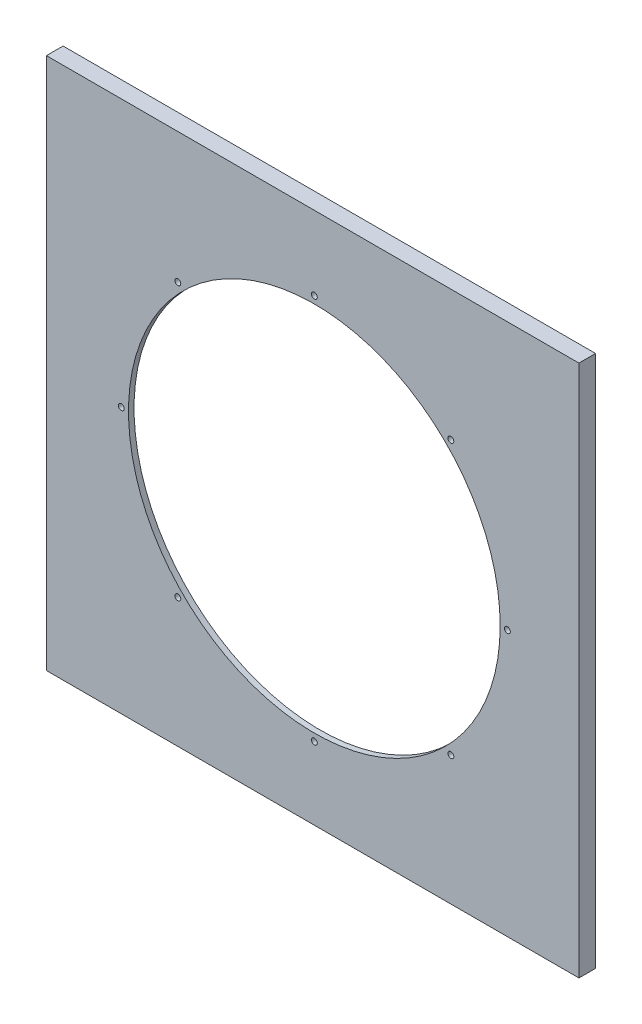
ISO-10303-21;
HEADER;
FILE_DESCRIPTION(('STEP AP214'),'2;1');
FILE_NAME('part.step','',(''),(''),'','','');
FILE_SCHEMA(('AUTOMOTIVE_DESIGN { 1 0 10303 214 1 1 1 1 }'));
ENDSEC;
DATA;
#1=APPLICATION_CONTEXT('core data for automotive mechanical design processes');
#2=APPLICATION_PROTOCOL_DEFINITION('international standard','automotive_design',2000,#1);
#3=PRODUCT_CONTEXT('',#1,'mechanical');
#4=PRODUCT('Part','Part','',(#3));
#5=PRODUCT_RELATED_PRODUCT_CATEGORY('part','',(#4));
#6=PRODUCT_DEFINITION_FORMATION('','',#4);
#7=PRODUCT_DEFINITION_CONTEXT('part definition',#1,'design');
#8=PRODUCT_DEFINITION('design','',#6,#7);
#9=PRODUCT_DEFINITION_SHAPE('','',#8);
#10=(LENGTH_UNIT() NAMED_UNIT(*) SI_UNIT(.MILLI.,.METRE.));
#11=(NAMED_UNIT(*) PLANE_ANGLE_UNIT() SI_UNIT($,.RADIAN.));
#12=(NAMED_UNIT(*) SI_UNIT($,.STERADIAN.) SOLID_ANGLE_UNIT());
#13=UNCERTAINTY_MEASURE_WITH_UNIT(LENGTH_MEASURE(1.E-05),#10,'distance_accuracy_value','');
#14=(GEOMETRIC_REPRESENTATION_CONTEXT(3) GLOBAL_UNCERTAINTY_ASSIGNED_CONTEXT((#13)) GLOBAL_UNIT_ASSIGNED_CONTEXT((#10,
#11,#12)) REPRESENTATION_CONTEXT('',''));
#15=CARTESIAN_POINT('',(0.,0.,0.));
#16=DIRECTION('',(0.,0.,1.));
#17=DIRECTION('',(1.,0.,0.));
#18=AXIS2_PLACEMENT_3D('',#15,#16,#17);
#19=CARTESIAN_POINT('',(1.90912582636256,220.236669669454,0.));
#20=DIRECTION('',(0.,0.,1.));
#21=DIRECTION('',(1.,0.,0.));
#22=AXIS2_PLACEMENT_3D('',#19,#20,#21);
#23=CYLINDRICAL_SURFACE('',#22,3.3655);
#24=CARTESIAN_POINT('',(1.90912582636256,220.236669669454,19.05));
#25=DIRECTION('',(0.,0.,1.));
#26=DIRECTION('',(1.,0.,0.));
#27=AXIS2_PLACEMENT_3D('',#24,#25,#26);
#28=CIRCLE('',#27,3.3655);
#29=CARTESIAN_POINT('',(5.27462582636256,220.236669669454,19.05));
#30=VERTEX_POINT('',#29);
#31=EDGE_CURVE('E102',#30,#30,#28,.T.);
#32=CARTESIAN_POINT('',(1.90912582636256,220.236669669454,12.7));
#33=DIRECTION('',(0.,0.,-1.));
#34=DIRECTION('',(-1.,0.,0.));
#35=AXIS2_PLACEMENT_3D('',#32,#33,#34);
#36=CIRCLE('',#35,3.3655);
#37=CARTESIAN_POINT('',(5.27462582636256,220.236669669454,12.7));
#38=VERTEX_POINT('',#37);
#39=EDGE_CURVE('E139',#38,#38,#36,.F.);
#40=CARTESIAN_POINT('',(5.27462582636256,220.236669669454,19.05));
#41=CARTESIAN_POINT('',(5.27462582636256,220.236669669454,18.9838541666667));
#42=CARTESIAN_POINT('',(5.27462582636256,220.236669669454,18.9177083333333));
#43=CARTESIAN_POINT('',(5.27462582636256,220.236669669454,18.7854166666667));
#44=CARTESIAN_POINT('',(5.27462582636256,220.236669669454,18.7192708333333));
#45=CARTESIAN_POINT('',(5.27462582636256,220.236669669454,18.5869791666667));
#46=CARTESIAN_POINT('',(5.27462582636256,220.236669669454,18.5208333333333));
#47=CARTESIAN_POINT('',(5.27462582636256,220.236669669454,18.3885416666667));
#48=CARTESIAN_POINT('',(5.27462582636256,220.236669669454,18.3223958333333));
#49=CARTESIAN_POINT('',(5.27462582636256,220.236669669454,18.1901041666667));
#50=CARTESIAN_POINT('',(5.27462582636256,220.236669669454,18.1239583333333));
#51=CARTESIAN_POINT('',(5.27462582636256,220.236669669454,17.9916666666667));
#52=CARTESIAN_POINT('',(5.27462582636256,220.236669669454,17.9255208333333));
#53=CARTESIAN_POINT('',(5.27462582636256,220.236669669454,17.7932291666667));
#54=CARTESIAN_POINT('',(5.27462582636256,220.236669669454,17.7270833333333));
#55=CARTESIAN_POINT('',(5.27462582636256,220.236669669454,17.5947916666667));
#56=CARTESIAN_POINT('',(5.27462582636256,220.236669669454,17.5286458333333));
#57=CARTESIAN_POINT('',(5.27462582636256,220.236669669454,17.3963541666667));
#58=CARTESIAN_POINT('',(5.27462582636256,220.236669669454,17.3302083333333));
#59=CARTESIAN_POINT('',(5.27462582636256,220.236669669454,17.1979166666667));
#60=CARTESIAN_POINT('',(5.27462582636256,220.236669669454,17.1317708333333));
#61=CARTESIAN_POINT('',(5.27462582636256,220.236669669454,16.9994791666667));
#62=CARTESIAN_POINT('',(5.27462582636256,220.236669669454,16.9333333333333));
#63=CARTESIAN_POINT('',(5.27462582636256,220.236669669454,16.8010416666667));
#64=CARTESIAN_POINT('',(5.27462582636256,220.236669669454,16.7348958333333));
#65=CARTESIAN_POINT('',(5.27462582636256,220.236669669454,16.6026041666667));
#66=CARTESIAN_POINT('',(5.27462582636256,220.236669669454,16.5364583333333));
#67=CARTESIAN_POINT('',(5.27462582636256,220.236669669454,16.4041666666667));
#68=CARTESIAN_POINT('',(5.27462582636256,220.236669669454,16.3380208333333));
#69=CARTESIAN_POINT('',(5.27462582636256,220.236669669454,16.2057291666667));
#70=CARTESIAN_POINT('',(5.27462582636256,220.236669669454,16.1395833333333));
#71=CARTESIAN_POINT('',(5.27462582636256,220.236669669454,16.0072916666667));
#72=CARTESIAN_POINT('',(5.27462582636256,220.236669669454,15.9411458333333));
#73=CARTESIAN_POINT('',(5.27462582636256,220.236669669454,15.8088541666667));
#74=CARTESIAN_POINT('',(5.27462582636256,220.236669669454,15.7427083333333));
#75=CARTESIAN_POINT('',(5.27462582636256,220.236669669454,15.6104166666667));
#76=CARTESIAN_POINT('',(5.27462582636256,220.236669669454,15.5442708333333));
#77=CARTESIAN_POINT('',(5.27462582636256,220.236669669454,15.4119791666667));
#78=CARTESIAN_POINT('',(5.27462582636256,220.236669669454,15.3458333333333));
#79=CARTESIAN_POINT('',(5.27462582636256,220.236669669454,15.2135416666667));
#80=CARTESIAN_POINT('',(5.27462582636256,220.236669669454,15.1473958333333));
#81=CARTESIAN_POINT('',(5.27462582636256,220.236669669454,15.0151041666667));
#82=CARTESIAN_POINT('',(5.27462582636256,220.236669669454,14.9489583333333));
#83=CARTESIAN_POINT('',(5.27462582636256,220.236669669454,14.8166666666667));
#84=CARTESIAN_POINT('',(5.27462582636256,220.236669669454,14.7505208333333));
#85=CARTESIAN_POINT('',(5.27462582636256,220.236669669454,14.6182291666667));
#86=CARTESIAN_POINT('',(5.27462582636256,220.236669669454,14.5520833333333));
#87=CARTESIAN_POINT('',(5.27462582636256,220.236669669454,14.4197916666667));
#88=CARTESIAN_POINT('',(5.27462582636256,220.236669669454,14.3536458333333));
#89=CARTESIAN_POINT('',(5.27462582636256,220.236669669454,14.2213541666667));
#90=CARTESIAN_POINT('',(5.27462582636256,220.236669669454,14.1552083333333));
#91=CARTESIAN_POINT('',(5.27462582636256,220.236669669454,14.0229166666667));
#92=CARTESIAN_POINT('',(5.27462582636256,220.236669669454,13.9567708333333));
#93=CARTESIAN_POINT('',(5.27462582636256,220.236669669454,13.8244791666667));
#94=CARTESIAN_POINT('',(5.27462582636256,220.236669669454,13.7583333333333));
#95=CARTESIAN_POINT('',(5.27462582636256,220.236669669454,13.6260416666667));
#96=CARTESIAN_POINT('',(5.27462582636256,220.236669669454,13.5598958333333));
#97=CARTESIAN_POINT('',(5.27462582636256,220.236669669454,13.4276041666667));
#98=CARTESIAN_POINT('',(5.27462582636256,220.236669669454,13.3614583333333));
#99=CARTESIAN_POINT('',(5.27462582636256,220.236669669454,13.2291666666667));
#100=CARTESIAN_POINT('',(5.27462582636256,220.236669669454,13.1630208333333));
#101=CARTESIAN_POINT('',(5.27462582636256,220.236669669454,13.0307291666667));
#102=CARTESIAN_POINT('',(5.27462582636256,220.236669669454,12.9645833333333));
#103=CARTESIAN_POINT('',(5.27462582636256,220.236669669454,12.8322916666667));
#104=CARTESIAN_POINT('',(5.27462582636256,220.236669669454,12.7661458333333));
#105=CARTESIAN_POINT('',(5.27462582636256,220.236669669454,12.7));
#106=B_SPLINE_CURVE_WITH_KNOTS('',3,(#40,#41,#42,#43,#44,#45,#46,#47,#48,#49,#50,#51,#52,#53,
#54,#55,#56,#57,#58,#59,#60,#61,#62,#63,#64,#65,#66,#67,#68,#69,#70,#71,#72,#73,#74,#75,#76,#77,
#78,#79,#80,#81,#82,#83,#84,#85,#86,#87,#88,#89,#90,#91,#92,#93,#94,#95,#96,#97,#98,#99,#100,
#101,#102,#103,#104,#105),.UNSPECIFIED.,.F.,.F.,(4,2,2,2,2,2,2,2,2,2,2,2,2,2,2,2,2,2,2,2,2,2,2,
2,2,2,2,2,2,2,2,2,4),(0.,0.198437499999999,0.396875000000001,0.5953125,0.793749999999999,
0.992187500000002,1.190625,1.3890625,1.5875,1.7859375,1.984375,2.1828125,2.38125,2.5796875,
2.778125,2.9765625,3.175,3.3734375,3.571875,3.7703125,3.96875,4.1671875,4.365625,4.5640625,
4.7625,4.9609375,5.159375,5.3578125,5.55625,5.7546875,5.953125,6.1515625,6.35),.UNSPECIFIED.);
#107=EDGE_CURVE('BSEAM33',#30,#38,#106,.T.);
#108=ORIENTED_EDGE('',*,*,#31,.T.);
#109=ORIENTED_EDGE('',*,*,#39,.F.);
#110=ORIENTED_EDGE('',*,*,#107,.T.);
#111=ORIENTED_EDGE('',*,*,#107,.F.);
#112=EDGE_LOOP('',(#108,#110,#109,#111));
#113=FACE_BOUND('',#112,.T.);
#114=ADVANCED_FACE('F33',(#113),#23,.F.);
#115=CARTESIAN_POINT('',(1.90912582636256,-0.763650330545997,0.));
#116=DIRECTION('',(0.,0.,1.));
#117=DIRECTION('',(1.,0.,0.));
#118=AXIS2_PLACEMENT_3D('',#115,#116,#117);
#119=CYLINDRICAL_SURFACE('',#118,212.725);
#120=CARTESIAN_POINT('',(1.90912582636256,-0.763650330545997,19.05));
#121=DIRECTION('',(0.,0.,1.));
#122=DIRECTION('',(1.,0.,0.));
#123=AXIS2_PLACEMENT_3D('',#120,#121,#122);
#124=CIRCLE('',#123,212.725);
#125=CARTESIAN_POINT('',(214.634125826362,-0.763650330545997,19.05));
#126=VERTEX_POINT('',#125);
#127=EDGE_CURVE('E115',#126,#126,#124,.T.);
#128=CARTESIAN_POINT('',(1.90912582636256,-0.763650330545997,12.7));
#129=DIRECTION('',(0.,0.,-1.));
#130=DIRECTION('',(-1.,0.,0.));
#131=AXIS2_PLACEMENT_3D('',#128,#129,#130);
#132=CIRCLE('',#131,212.725);
#133=CARTESIAN_POINT('',(214.634125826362,-0.763650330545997,12.7));
#134=VERTEX_POINT('',#133);
#135=EDGE_CURVE('E142',#134,#134,#132,.F.);
#136=CARTESIAN_POINT('',(214.634125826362,-0.763650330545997,19.05));
#137=CARTESIAN_POINT('',(214.634125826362,-0.763650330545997,18.9838541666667));
#138=CARTESIAN_POINT('',(214.634125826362,-0.763650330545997,18.9177083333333));
#139=CARTESIAN_POINT('',(214.634125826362,-0.763650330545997,18.7854166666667));
#140=CARTESIAN_POINT('',(214.634125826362,-0.763650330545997,18.7192708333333));
#141=CARTESIAN_POINT('',(214.634125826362,-0.763650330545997,18.5869791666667));
#142=CARTESIAN_POINT('',(214.634125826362,-0.763650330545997,18.5208333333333));
#143=CARTESIAN_POINT('',(214.634125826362,-0.763650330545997,18.3885416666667));
#144=CARTESIAN_POINT('',(214.634125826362,-0.763650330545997,18.3223958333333));
#145=CARTESIAN_POINT('',(214.634125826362,-0.763650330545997,18.1901041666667));
#146=CARTESIAN_POINT('',(214.634125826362,-0.763650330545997,18.1239583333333));
#147=CARTESIAN_POINT('',(214.634125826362,-0.763650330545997,17.9916666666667));
#148=CARTESIAN_POINT('',(214.634125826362,-0.763650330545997,17.9255208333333));
#149=CARTESIAN_POINT('',(214.634125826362,-0.763650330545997,17.7932291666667));
#150=CARTESIAN_POINT('',(214.634125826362,-0.763650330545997,17.7270833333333));
#151=CARTESIAN_POINT('',(214.634125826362,-0.763650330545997,17.5947916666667));
#152=CARTESIAN_POINT('',(214.634125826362,-0.763650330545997,17.5286458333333));
#153=CARTESIAN_POINT('',(214.634125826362,-0.763650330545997,17.3963541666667));
#154=CARTESIAN_POINT('',(214.634125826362,-0.763650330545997,17.3302083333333));
#155=CARTESIAN_POINT('',(214.634125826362,-0.763650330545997,17.1979166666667));
#156=CARTESIAN_POINT('',(214.634125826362,-0.763650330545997,17.1317708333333));
#157=CARTESIAN_POINT('',(214.634125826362,-0.763650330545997,16.9994791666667));
#158=CARTESIAN_POINT('',(214.634125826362,-0.763650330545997,16.9333333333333));
#159=CARTESIAN_POINT('',(214.634125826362,-0.763650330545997,16.8010416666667));
#160=CARTESIAN_POINT('',(214.634125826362,-0.763650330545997,16.7348958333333));
#161=CARTESIAN_POINT('',(214.634125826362,-0.763650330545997,16.6026041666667));
#162=CARTESIAN_POINT('',(214.634125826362,-0.763650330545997,16.5364583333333));
#163=CARTESIAN_POINT('',(214.634125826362,-0.763650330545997,16.4041666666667));
#164=CARTESIAN_POINT('',(214.634125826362,-0.763650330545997,16.3380208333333));
#165=CARTESIAN_POINT('',(214.634125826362,-0.763650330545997,16.2057291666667));
#166=CARTESIAN_POINT('',(214.634125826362,-0.763650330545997,16.1395833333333));
#167=CARTESIAN_POINT('',(214.634125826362,-0.763650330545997,16.0072916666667));
#168=CARTESIAN_POINT('',(214.634125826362,-0.763650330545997,15.9411458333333));
#169=CARTESIAN_POINT('',(214.634125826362,-0.763650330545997,15.8088541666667));
#170=CARTESIAN_POINT('',(214.634125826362,-0.763650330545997,15.7427083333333));
#171=CARTESIAN_POINT('',(214.634125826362,-0.763650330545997,15.6104166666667));
#172=CARTESIAN_POINT('',(214.634125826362,-0.763650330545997,15.5442708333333));
#173=CARTESIAN_POINT('',(214.634125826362,-0.763650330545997,15.4119791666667));
#174=CARTESIAN_POINT('',(214.634125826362,-0.763650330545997,15.3458333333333));
#175=CARTESIAN_POINT('',(214.634125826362,-0.763650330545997,15.2135416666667));
#176=CARTESIAN_POINT('',(214.634125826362,-0.763650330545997,15.1473958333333));
#177=CARTESIAN_POINT('',(214.634125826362,-0.763650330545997,15.0151041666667));
#178=CARTESIAN_POINT('',(214.634125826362,-0.763650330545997,14.9489583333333));
#179=CARTESIAN_POINT('',(214.634125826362,-0.763650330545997,14.8166666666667));
#180=CARTESIAN_POINT('',(214.634125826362,-0.763650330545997,14.7505208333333));
#181=CARTESIAN_POINT('',(214.634125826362,-0.763650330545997,14.6182291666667));
#182=CARTESIAN_POINT('',(214.634125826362,-0.763650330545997,14.5520833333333));
#183=CARTESIAN_POINT('',(214.634125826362,-0.763650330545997,14.4197916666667));
#184=CARTESIAN_POINT('',(214.634125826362,-0.763650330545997,14.3536458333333));
#185=CARTESIAN_POINT('',(214.634125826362,-0.763650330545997,14.2213541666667));
#186=CARTESIAN_POINT('',(214.634125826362,-0.763650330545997,14.1552083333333));
#187=CARTESIAN_POINT('',(214.634125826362,-0.763650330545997,14.0229166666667));
#188=CARTESIAN_POINT('',(214.634125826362,-0.763650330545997,13.9567708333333));
#189=CARTESIAN_POINT('',(214.634125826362,-0.763650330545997,13.8244791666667));
#190=CARTESIAN_POINT('',(214.634125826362,-0.763650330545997,13.7583333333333));
#191=CARTESIAN_POINT('',(214.634125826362,-0.763650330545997,13.6260416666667));
#192=CARTESIAN_POINT('',(214.634125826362,-0.763650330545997,13.5598958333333));
#193=CARTESIAN_POINT('',(214.634125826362,-0.763650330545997,13.4276041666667));
#194=CARTESIAN_POINT('',(214.634125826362,-0.763650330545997,13.3614583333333));
#195=CARTESIAN_POINT('',(214.634125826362,-0.763650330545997,13.2291666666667));
#196=CARTESIAN_POINT('',(214.634125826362,-0.763650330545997,13.1630208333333));
#197=CARTESIAN_POINT('',(214.634125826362,-0.763650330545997,13.0307291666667));
#198=CARTESIAN_POINT('',(214.634125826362,-0.763650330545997,12.9645833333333));
#199=CARTESIAN_POINT('',(214.634125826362,-0.763650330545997,12.8322916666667));
#200=CARTESIAN_POINT('',(214.634125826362,-0.763650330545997,12.7661458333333));
#201=CARTESIAN_POINT('',(214.634125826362,-0.763650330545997,12.7));
#202=B_SPLINE_CURVE_WITH_KNOTS('',3,(#136,#137,#138,#139,#140,#141,#142,#143,#144,#145,#146,
#147,#148,#149,#150,#151,#152,#153,#154,#155,#156,#157,#158,#159,#160,#161,#162,#163,#164,#165,
#166,#167,#168,#169,#170,#171,#172,#173,#174,#175,#176,#177,#178,#179,#180,#181,#182,#183,#184,
#185,#186,#187,#188,#189,#190,#191,#192,#193,#194,#195,#196,#197,#198,#199,#200,#201),
.UNSPECIFIED.,.F.,.F.,(4,2,2,2,2,2,2,2,2,2,2,2,2,2,2,2,2,2,2,2,2,2,2,2,2,2,2,2,2,2,2,2,4),(0.,
0.198437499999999,0.396875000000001,0.5953125,0.793749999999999,0.992187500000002,1.190625,
1.3890625,1.5875,1.7859375,1.984375,2.1828125,2.38125,2.5796875,2.778125,2.9765625,3.175,
3.3734375,3.571875,3.7703125,3.96875,4.1671875,4.365625,4.5640625,4.7625,4.9609375,5.159375,
5.3578125,5.55625,5.7546875,5.953125,6.1515625,6.35),.UNSPECIFIED.);
#203=EDGE_CURVE('BSEAM190',#126,#134,#202,.T.);
#204=ORIENTED_EDGE('',*,*,#127,.T.);
#205=ORIENTED_EDGE('',*,*,#135,.F.);
#206=ORIENTED_EDGE('',*,*,#203,.T.);
#207=ORIENTED_EDGE('',*,*,#203,.F.);
#208=EDGE_LOOP('',(#204,#206,#205,#207));
#209=FACE_BOUND('',#208,.T.);
#210=ADVANCED_FACE('F190',(#209),#119,.F.);
#211=CARTESIAN_POINT('',(158.17995074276,155.50717458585,0.));
#212=DIRECTION('',(0.,0.,1.));
#213=DIRECTION('',(1.,0.,0.));
#214=AXIS2_PLACEMENT_3D('',#211,#212,#213);
#215=CYLINDRICAL_SURFACE('',#214,3.36549999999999);
#216=CARTESIAN_POINT('',(158.17995074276,155.50717458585,19.05));
#217=DIRECTION('',(0.,0.,1.));
#218=DIRECTION('',(1.,0.,0.));
#219=AXIS2_PLACEMENT_3D('',#216,#217,#218);
#220=CIRCLE('',#219,3.36549999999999);
#221=CARTESIAN_POINT('',(161.54545074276,155.50717458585,19.05));
#222=VERTEX_POINT('',#221);
#223=EDGE_CURVE('E118',#222,#222,#220,.T.);
#224=CARTESIAN_POINT('',(158.17995074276,155.50717458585,12.7));
#225=DIRECTION('',(0.,0.,-1.));
#226=DIRECTION('',(-1.,0.,0.));
#227=AXIS2_PLACEMENT_3D('',#224,#225,#226);
#228=CIRCLE('',#227,3.36549999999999);
#229=CARTESIAN_POINT('',(161.54545074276,155.50717458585,12.7));
#230=VERTEX_POINT('',#229);
#231=EDGE_CURVE('E145',#230,#230,#228,.F.);
#232=CARTESIAN_POINT('',(161.54545074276,155.50717458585,19.05));
#233=CARTESIAN_POINT('',(161.54545074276,155.50717458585,18.9838541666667));
#234=CARTESIAN_POINT('',(161.54545074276,155.50717458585,18.9177083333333));
#235=CARTESIAN_POINT('',(161.54545074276,155.50717458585,18.7854166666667));
#236=CARTESIAN_POINT('',(161.54545074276,155.50717458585,18.7192708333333));
#237=CARTESIAN_POINT('',(161.54545074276,155.50717458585,18.5869791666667));
#238=CARTESIAN_POINT('',(161.54545074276,155.50717458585,18.5208333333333));
#239=CARTESIAN_POINT('',(161.54545074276,155.50717458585,18.3885416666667));
#240=CARTESIAN_POINT('',(161.54545074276,155.50717458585,18.3223958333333));
#241=CARTESIAN_POINT('',(161.54545074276,155.50717458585,18.1901041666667));
#242=CARTESIAN_POINT('',(161.54545074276,155.50717458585,18.1239583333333));
#243=CARTESIAN_POINT('',(161.54545074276,155.50717458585,17.9916666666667));
#244=CARTESIAN_POINT('',(161.54545074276,155.50717458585,17.9255208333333));
#245=CARTESIAN_POINT('',(161.54545074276,155.50717458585,17.7932291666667));
#246=CARTESIAN_POINT('',(161.54545074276,155.50717458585,17.7270833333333));
#247=CARTESIAN_POINT('',(161.54545074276,155.50717458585,17.5947916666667));
#248=CARTESIAN_POINT('',(161.54545074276,155.50717458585,17.5286458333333));
#249=CARTESIAN_POINT('',(161.54545074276,155.50717458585,17.3963541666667));
#250=CARTESIAN_POINT('',(161.54545074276,155.50717458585,17.3302083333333));
#251=CARTESIAN_POINT('',(161.54545074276,155.50717458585,17.1979166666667));
#252=CARTESIAN_POINT('',(161.54545074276,155.50717458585,17.1317708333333));
#253=CARTESIAN_POINT('',(161.54545074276,155.50717458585,16.9994791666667));
#254=CARTESIAN_POINT('',(161.54545074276,155.50717458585,16.9333333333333));
#255=CARTESIAN_POINT('',(161.54545074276,155.50717458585,16.8010416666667));
#256=CARTESIAN_POINT('',(161.54545074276,155.50717458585,16.7348958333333));
#257=CARTESIAN_POINT('',(161.54545074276,155.50717458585,16.6026041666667));
#258=CARTESIAN_POINT('',(161.54545074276,155.50717458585,16.5364583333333));
#259=CARTESIAN_POINT('',(161.54545074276,155.50717458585,16.4041666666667));
#260=CARTESIAN_POINT('',(161.54545074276,155.50717458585,16.3380208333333));
#261=CARTESIAN_POINT('',(161.54545074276,155.50717458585,16.2057291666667));
#262=CARTESIAN_POINT('',(161.54545074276,155.50717458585,16.1395833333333));
#263=CARTESIAN_POINT('',(161.54545074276,155.50717458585,16.0072916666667));
#264=CARTESIAN_POINT('',(161.54545074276,155.50717458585,15.9411458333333));
#265=CARTESIAN_POINT('',(161.54545074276,155.50717458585,15.8088541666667));
#266=CARTESIAN_POINT('',(161.54545074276,155.50717458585,15.7427083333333));
#267=CARTESIAN_POINT('',(161.54545074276,155.50717458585,15.6104166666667));
#268=CARTESIAN_POINT('',(161.54545074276,155.50717458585,15.5442708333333));
#269=CARTESIAN_POINT('',(161.54545074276,155.50717458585,15.4119791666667));
#270=CARTESIAN_POINT('',(161.54545074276,155.50717458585,15.3458333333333));
#271=CARTESIAN_POINT('',(161.54545074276,155.50717458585,15.2135416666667));
#272=CARTESIAN_POINT('',(161.54545074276,155.50717458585,15.1473958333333));
#273=CARTESIAN_POINT('',(161.54545074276,155.50717458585,15.0151041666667));
#274=CARTESIAN_POINT('',(161.54545074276,155.50717458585,14.9489583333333));
#275=CARTESIAN_POINT('',(161.54545074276,155.50717458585,14.8166666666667));
#276=CARTESIAN_POINT('',(161.54545074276,155.50717458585,14.7505208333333));
#277=CARTESIAN_POINT('',(161.54545074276,155.50717458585,14.6182291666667));
#278=CARTESIAN_POINT('',(161.54545074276,155.50717458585,14.5520833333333));
#279=CARTESIAN_POINT('',(161.54545074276,155.50717458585,14.4197916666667));
#280=CARTESIAN_POINT('',(161.54545074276,155.50717458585,14.3536458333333));
#281=CARTESIAN_POINT('',(161.54545074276,155.50717458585,14.2213541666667));
#282=CARTESIAN_POINT('',(161.54545074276,155.50717458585,14.1552083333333));
#283=CARTESIAN_POINT('',(161.54545074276,155.50717458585,14.0229166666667));
#284=CARTESIAN_POINT('',(161.54545074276,155.50717458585,13.9567708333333));
#285=CARTESIAN_POINT('',(161.54545074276,155.50717458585,13.8244791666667));
#286=CARTESIAN_POINT('',(161.54545074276,155.50717458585,13.7583333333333));
#287=CARTESIAN_POINT('',(161.54545074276,155.50717458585,13.6260416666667));
#288=CARTESIAN_POINT('',(161.54545074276,155.50717458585,13.5598958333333));
#289=CARTESIAN_POINT('',(161.54545074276,155.50717458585,13.4276041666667));
#290=CARTESIAN_POINT('',(161.54545074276,155.50717458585,13.3614583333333));
#291=CARTESIAN_POINT('',(161.54545074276,155.50717458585,13.2291666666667));
#292=CARTESIAN_POINT('',(161.54545074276,155.50717458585,13.1630208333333));
#293=CARTESIAN_POINT('',(161.54545074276,155.50717458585,13.0307291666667));
#294=CARTESIAN_POINT('',(161.54545074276,155.50717458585,12.9645833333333));
#295=CARTESIAN_POINT('',(161.54545074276,155.50717458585,12.8322916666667));
#296=CARTESIAN_POINT('',(161.54545074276,155.50717458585,12.7661458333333));
#297=CARTESIAN_POINT('',(161.54545074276,155.50717458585,12.7));
#298=B_SPLINE_CURVE_WITH_KNOTS('',3,(#232,#233,#234,#235,#236,#237,#238,#239,#240,#241,#242,
#243,#244,#245,#246,#247,#248,#249,#250,#251,#252,#253,#254,#255,#256,#257,#258,#259,#260,#261,
#262,#263,#264,#265,#266,#267,#268,#269,#270,#271,#272,#273,#274,#275,#276,#277,#278,#279,#280,
#281,#282,#283,#284,#285,#286,#287,#288,#289,#290,#291,#292,#293,#294,#295,#296,#297),
.UNSPECIFIED.,.F.,.F.,(4,2,2,2,2,2,2,2,2,2,2,2,2,2,2,2,2,2,2,2,2,2,2,2,2,2,2,2,2,2,2,2,4),(0.,
0.198437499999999,0.396875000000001,0.5953125,0.793749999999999,0.992187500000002,1.190625,
1.3890625,1.5875,1.7859375,1.984375,2.1828125,2.38125,2.5796875,2.778125,2.9765625,3.175,
3.3734375,3.571875,3.7703125,3.96875,4.1671875,4.365625,4.5640625,4.7625,4.9609375,5.159375,
5.3578125,5.55625,5.7546875,5.953125,6.1515625,6.35),.UNSPECIFIED.);
#299=EDGE_CURVE('BSEAM196',#222,#230,#298,.T.);
#300=ORIENTED_EDGE('',*,*,#223,.T.);
#301=ORIENTED_EDGE('',*,*,#231,.F.);
#302=ORIENTED_EDGE('',*,*,#299,.T.);
#303=ORIENTED_EDGE('',*,*,#299,.F.);
#304=EDGE_LOOP('',(#300,#302,#301,#303));
#305=FACE_BOUND('',#304,.T.);
#306=ADVANCED_FACE('F196',(#305),#215,.F.);
#307=CARTESIAN_POINT('',(222.909445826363,-0.763650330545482,0.));
#308=DIRECTION('',(0.,0.,1.));
#309=DIRECTION('',(1.,0.,0.));
#310=AXIS2_PLACEMENT_3D('',#307,#308,#309);
#311=CYLINDRICAL_SURFACE('',#310,3.36549999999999);
#312=CARTESIAN_POINT('',(222.909445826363,-0.763650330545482,19.05));
#313=DIRECTION('',(0.,0.,1.));
#314=DIRECTION('',(1.,0.,0.));
#315=AXIS2_PLACEMENT_3D('',#312,#313,#314);
#316=CIRCLE('',#315,3.36549999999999);
#317=CARTESIAN_POINT('',(226.274945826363,-0.763650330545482,19.05));
#318=VERTEX_POINT('',#317);
#319=EDGE_CURVE('E121',#318,#318,#316,.T.);
#320=CARTESIAN_POINT('',(222.909445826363,-0.763650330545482,12.7));
#321=DIRECTION('',(0.,0.,-1.));
#322=DIRECTION('',(-1.,0.,0.));
#323=AXIS2_PLACEMENT_3D('',#320,#321,#322);
#324=CIRCLE('',#323,3.36549999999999);
#325=CARTESIAN_POINT('',(226.274945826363,-0.763650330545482,12.7));
#326=VERTEX_POINT('',#325);
#327=EDGE_CURVE('E148',#326,#326,#324,.F.);
#328=CARTESIAN_POINT('',(226.274945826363,-0.763650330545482,19.05));
#329=CARTESIAN_POINT('',(226.274945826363,-0.763650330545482,18.9838541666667));
#330=CARTESIAN_POINT('',(226.274945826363,-0.763650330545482,18.9177083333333));
#331=CARTESIAN_POINT('',(226.274945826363,-0.763650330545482,18.7854166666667));
#332=CARTESIAN_POINT('',(226.274945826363,-0.763650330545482,18.7192708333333));
#333=CARTESIAN_POINT('',(226.274945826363,-0.763650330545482,18.5869791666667));
#334=CARTESIAN_POINT('',(226.274945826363,-0.763650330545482,18.5208333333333));
#335=CARTESIAN_POINT('',(226.274945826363,-0.763650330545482,18.3885416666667));
#336=CARTESIAN_POINT('',(226.274945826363,-0.763650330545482,18.3223958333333));
#337=CARTESIAN_POINT('',(226.274945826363,-0.763650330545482,18.1901041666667));
#338=CARTESIAN_POINT('',(226.274945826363,-0.763650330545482,18.1239583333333));
#339=CARTESIAN_POINT('',(226.274945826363,-0.763650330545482,17.9916666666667));
#340=CARTESIAN_POINT('',(226.274945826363,-0.763650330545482,17.9255208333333));
#341=CARTESIAN_POINT('',(226.274945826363,-0.763650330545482,17.7932291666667));
#342=CARTESIAN_POINT('',(226.274945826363,-0.763650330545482,17.7270833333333));
#343=CARTESIAN_POINT('',(226.274945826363,-0.763650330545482,17.5947916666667));
#344=CARTESIAN_POINT('',(226.274945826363,-0.763650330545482,17.5286458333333));
#345=CARTESIAN_POINT('',(226.274945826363,-0.763650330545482,17.3963541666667));
#346=CARTESIAN_POINT('',(226.274945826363,-0.763650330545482,17.3302083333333));
#347=CARTESIAN_POINT('',(226.274945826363,-0.763650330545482,17.1979166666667));
#348=CARTESIAN_POINT('',(226.274945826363,-0.763650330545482,17.1317708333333));
#349=CARTESIAN_POINT('',(226.274945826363,-0.763650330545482,16.9994791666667));
#350=CARTESIAN_POINT('',(226.274945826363,-0.763650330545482,16.9333333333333));
#351=CARTESIAN_POINT('',(226.274945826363,-0.763650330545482,16.8010416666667));
#352=CARTESIAN_POINT('',(226.274945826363,-0.763650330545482,16.7348958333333));
#353=CARTESIAN_POINT('',(226.274945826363,-0.763650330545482,16.6026041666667));
#354=CARTESIAN_POINT('',(226.274945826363,-0.763650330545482,16.5364583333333));
#355=CARTESIAN_POINT('',(226.274945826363,-0.763650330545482,16.4041666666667));
#356=CARTESIAN_POINT('',(226.274945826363,-0.763650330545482,16.3380208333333));
#357=CARTESIAN_POINT('',(226.274945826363,-0.763650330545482,16.2057291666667));
#358=CARTESIAN_POINT('',(226.274945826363,-0.763650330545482,16.1395833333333));
#359=CARTESIAN_POINT('',(226.274945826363,-0.763650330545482,16.0072916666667));
#360=CARTESIAN_POINT('',(226.274945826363,-0.763650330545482,15.9411458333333));
#361=CARTESIAN_POINT('',(226.274945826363,-0.763650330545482,15.8088541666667));
#362=CARTESIAN_POINT('',(226.274945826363,-0.763650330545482,15.7427083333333));
#363=CARTESIAN_POINT('',(226.274945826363,-0.763650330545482,15.6104166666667));
#364=CARTESIAN_POINT('',(226.274945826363,-0.763650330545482,15.5442708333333));
#365=CARTESIAN_POINT('',(226.274945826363,-0.763650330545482,15.4119791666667));
#366=CARTESIAN_POINT('',(226.274945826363,-0.763650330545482,15.3458333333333));
#367=CARTESIAN_POINT('',(226.274945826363,-0.763650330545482,15.2135416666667));
#368=CARTESIAN_POINT('',(226.274945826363,-0.763650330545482,15.1473958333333));
#369=CARTESIAN_POINT('',(226.274945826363,-0.763650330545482,15.0151041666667));
#370=CARTESIAN_POINT('',(226.274945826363,-0.763650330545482,14.9489583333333));
#371=CARTESIAN_POINT('',(226.274945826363,-0.763650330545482,14.8166666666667));
#372=CARTESIAN_POINT('',(226.274945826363,-0.763650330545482,14.7505208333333));
#373=CARTESIAN_POINT('',(226.274945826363,-0.763650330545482,14.6182291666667));
#374=CARTESIAN_POINT('',(226.274945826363,-0.763650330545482,14.5520833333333));
#375=CARTESIAN_POINT('',(226.274945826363,-0.763650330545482,14.4197916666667));
#376=CARTESIAN_POINT('',(226.274945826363,-0.763650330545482,14.3536458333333));
#377=CARTESIAN_POINT('',(226.274945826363,-0.763650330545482,14.2213541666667));
#378=CARTESIAN_POINT('',(226.274945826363,-0.763650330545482,14.1552083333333));
#379=CARTESIAN_POINT('',(226.274945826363,-0.763650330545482,14.0229166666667));
#380=CARTESIAN_POINT('',(226.274945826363,-0.763650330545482,13.9567708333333));
#381=CARTESIAN_POINT('',(226.274945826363,-0.763650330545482,13.8244791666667));
#382=CARTESIAN_POINT('',(226.274945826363,-0.763650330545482,13.7583333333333));
#383=CARTESIAN_POINT('',(226.274945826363,-0.763650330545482,13.6260416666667));
#384=CARTESIAN_POINT('',(226.274945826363,-0.763650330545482,13.5598958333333));
#385=CARTESIAN_POINT('',(226.274945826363,-0.763650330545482,13.4276041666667));
#386=CARTESIAN_POINT('',(226.274945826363,-0.763650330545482,13.3614583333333));
#387=CARTESIAN_POINT('',(226.274945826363,-0.763650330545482,13.2291666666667));
#388=CARTESIAN_POINT('',(226.274945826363,-0.763650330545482,13.1630208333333));
#389=CARTESIAN_POINT('',(226.274945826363,-0.763650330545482,13.0307291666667));
#390=CARTESIAN_POINT('',(226.274945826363,-0.763650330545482,12.9645833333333));
#391=CARTESIAN_POINT('',(226.274945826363,-0.763650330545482,12.8322916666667));
#392=CARTESIAN_POINT('',(226.274945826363,-0.763650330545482,12.7661458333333));
#393=CARTESIAN_POINT('',(226.274945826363,-0.763650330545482,12.7));
#394=B_SPLINE_CURVE_WITH_KNOTS('',3,(#328,#329,#330,#331,#332,#333,#334,#335,#336,#337,#338,
#339,#340,#341,#342,#343,#344,#345,#346,#347,#348,#349,#350,#351,#352,#353,#354,#355,#356,#357,
#358,#359,#360,#361,#362,#363,#364,#365,#366,#367,#368,#369,#370,#371,#372,#373,#374,#375,#376,
#377,#378,#379,#380,#381,#382,#383,#384,#385,#386,#387,#388,#389,#390,#391,#392,#393),
.UNSPECIFIED.,.F.,.F.,(4,2,2,2,2,2,2,2,2,2,2,2,2,2,2,2,2,2,2,2,2,2,2,2,2,2,2,2,2,2,2,2,4),(0.,
0.198437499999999,0.396875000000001,0.5953125,0.793749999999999,0.992187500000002,1.190625,
1.3890625,1.5875,1.7859375,1.984375,2.1828125,2.38125,2.5796875,2.778125,2.9765625,3.175,
3.3734375,3.571875,3.7703125,3.96875,4.1671875,4.365625,4.5640625,4.7625,4.9609375,5.159375,
5.3578125,5.55625,5.7546875,5.953125,6.1515625,6.35),.UNSPECIFIED.);
#395=EDGE_CURVE('BSEAM267',#318,#326,#394,.T.);
#396=ORIENTED_EDGE('',*,*,#319,.T.);
#397=ORIENTED_EDGE('',*,*,#327,.F.);
#398=ORIENTED_EDGE('',*,*,#395,.T.);
#399=ORIENTED_EDGE('',*,*,#395,.F.);
#400=EDGE_LOOP('',(#396,#398,#397,#399));
#401=FACE_BOUND('',#400,.T.);
#402=ADVANCED_FACE('F267',(#401),#311,.F.);
#403=CARTESIAN_POINT('',(158.17995074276,-157.034475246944,0.));
#404=DIRECTION('',(0.,0.,1.));
#405=DIRECTION('',(1.,0.,0.));
#406=AXIS2_PLACEMENT_3D('',#403,#404,#405);
#407=CYLINDRICAL_SURFACE('',#406,3.36549999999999);
#408=CARTESIAN_POINT('',(158.17995074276,-157.034475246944,19.05));
#409=DIRECTION('',(0.,0.,1.));
#410=DIRECTION('',(1.,0.,0.));
#411=AXIS2_PLACEMENT_3D('',#408,#409,#410);
#412=CIRCLE('',#411,3.36549999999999);
#413=CARTESIAN_POINT('',(161.54545074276,-157.034475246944,19.05));
#414=VERTEX_POINT('',#413);
#415=EDGE_CURVE('E124',#414,#414,#412,.T.);
#416=CARTESIAN_POINT('',(158.17995074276,-157.034475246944,12.7));
#417=DIRECTION('',(0.,0.,-1.));
#418=DIRECTION('',(-1.,0.,0.));
#419=AXIS2_PLACEMENT_3D('',#416,#417,#418);
#420=CIRCLE('',#419,3.36549999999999);
#421=CARTESIAN_POINT('',(161.54545074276,-157.034475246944,12.7));
#422=VERTEX_POINT('',#421);
#423=EDGE_CURVE('E151',#422,#422,#420,.F.);
#424=CARTESIAN_POINT('',(161.54545074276,-157.034475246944,19.05));
#425=CARTESIAN_POINT('',(161.54545074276,-157.034475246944,18.9838541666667));
#426=CARTESIAN_POINT('',(161.54545074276,-157.034475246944,18.9177083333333));
#427=CARTESIAN_POINT('',(161.54545074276,-157.034475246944,18.7854166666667));
#428=CARTESIAN_POINT('',(161.54545074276,-157.034475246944,18.7192708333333));
#429=CARTESIAN_POINT('',(161.54545074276,-157.034475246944,18.5869791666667));
#430=CARTESIAN_POINT('',(161.54545074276,-157.034475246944,18.5208333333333));
#431=CARTESIAN_POINT('',(161.54545074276,-157.034475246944,18.3885416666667));
#432=CARTESIAN_POINT('',(161.54545074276,-157.034475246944,18.3223958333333));
#433=CARTESIAN_POINT('',(161.54545074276,-157.034475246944,18.1901041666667));
#434=CARTESIAN_POINT('',(161.54545074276,-157.034475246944,18.1239583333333));
#435=CARTESIAN_POINT('',(161.54545074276,-157.034475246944,17.9916666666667));
#436=CARTESIAN_POINT('',(161.54545074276,-157.034475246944,17.9255208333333));
#437=CARTESIAN_POINT('',(161.54545074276,-157.034475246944,17.7932291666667));
#438=CARTESIAN_POINT('',(161.54545074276,-157.034475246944,17.7270833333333));
#439=CARTESIAN_POINT('',(161.54545074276,-157.034475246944,17.5947916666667));
#440=CARTESIAN_POINT('',(161.54545074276,-157.034475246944,17.5286458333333));
#441=CARTESIAN_POINT('',(161.54545074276,-157.034475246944,17.3963541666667));
#442=CARTESIAN_POINT('',(161.54545074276,-157.034475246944,17.3302083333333));
#443=CARTESIAN_POINT('',(161.54545074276,-157.034475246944,17.1979166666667));
#444=CARTESIAN_POINT('',(161.54545074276,-157.034475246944,17.1317708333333));
#445=CARTESIAN_POINT('',(161.54545074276,-157.034475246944,16.9994791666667));
#446=CARTESIAN_POINT('',(161.54545074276,-157.034475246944,16.9333333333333));
#447=CARTESIAN_POINT('',(161.54545074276,-157.034475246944,16.8010416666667));
#448=CARTESIAN_POINT('',(161.54545074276,-157.034475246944,16.7348958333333));
#449=CARTESIAN_POINT('',(161.54545074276,-157.034475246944,16.6026041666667));
#450=CARTESIAN_POINT('',(161.54545074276,-157.034475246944,16.5364583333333));
#451=CARTESIAN_POINT('',(161.54545074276,-157.034475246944,16.4041666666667));
#452=CARTESIAN_POINT('',(161.54545074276,-157.034475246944,16.3380208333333));
#453=CARTESIAN_POINT('',(161.54545074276,-157.034475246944,16.2057291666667));
#454=CARTESIAN_POINT('',(161.54545074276,-157.034475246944,16.1395833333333));
#455=CARTESIAN_POINT('',(161.54545074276,-157.034475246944,16.0072916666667));
#456=CARTESIAN_POINT('',(161.54545074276,-157.034475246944,15.9411458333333));
#457=CARTESIAN_POINT('',(161.54545074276,-157.034475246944,15.8088541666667));
#458=CARTESIAN_POINT('',(161.54545074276,-157.034475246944,15.7427083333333));
#459=CARTESIAN_POINT('',(161.54545074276,-157.034475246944,15.6104166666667));
#460=CARTESIAN_POINT('',(161.54545074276,-157.034475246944,15.5442708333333));
#461=CARTESIAN_POINT('',(161.54545074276,-157.034475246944,15.4119791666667));
#462=CARTESIAN_POINT('',(161.54545074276,-157.034475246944,15.3458333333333));
#463=CARTESIAN_POINT('',(161.54545074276,-157.034475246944,15.2135416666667));
#464=CARTESIAN_POINT('',(161.54545074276,-157.034475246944,15.1473958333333));
#465=CARTESIAN_POINT('',(161.54545074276,-157.034475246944,15.0151041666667));
#466=CARTESIAN_POINT('',(161.54545074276,-157.034475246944,14.9489583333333));
#467=CARTESIAN_POINT('',(161.54545074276,-157.034475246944,14.8166666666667));
#468=CARTESIAN_POINT('',(161.54545074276,-157.034475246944,14.7505208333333));
#469=CARTESIAN_POINT('',(161.54545074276,-157.034475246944,14.6182291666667));
#470=CARTESIAN_POINT('',(161.54545074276,-157.034475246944,14.5520833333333));
#471=CARTESIAN_POINT('',(161.54545074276,-157.034475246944,14.4197916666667));
#472=CARTESIAN_POINT('',(161.54545074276,-157.034475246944,14.3536458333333));
#473=CARTESIAN_POINT('',(161.54545074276,-157.034475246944,14.2213541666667));
#474=CARTESIAN_POINT('',(161.54545074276,-157.034475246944,14.1552083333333));
#475=CARTESIAN_POINT('',(161.54545074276,-157.034475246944,14.0229166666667));
#476=CARTESIAN_POINT('',(161.54545074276,-157.034475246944,13.9567708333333));
#477=CARTESIAN_POINT('',(161.54545074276,-157.034475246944,13.8244791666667));
#478=CARTESIAN_POINT('',(161.54545074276,-157.034475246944,13.7583333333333));
#479=CARTESIAN_POINT('',(161.54545074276,-157.034475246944,13.6260416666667));
#480=CARTESIAN_POINT('',(161.54545074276,-157.034475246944,13.5598958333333));
#481=CARTESIAN_POINT('',(161.54545074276,-157.034475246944,13.4276041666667));
#482=CARTESIAN_POINT('',(161.54545074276,-157.034475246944,13.3614583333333));
#483=CARTESIAN_POINT('',(161.54545074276,-157.034475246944,13.2291666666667));
#484=CARTESIAN_POINT('',(161.54545074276,-157.034475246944,13.1630208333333));
#485=CARTESIAN_POINT('',(161.54545074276,-157.034475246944,13.0307291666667));
#486=CARTESIAN_POINT('',(161.54545074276,-157.034475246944,12.9645833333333));
#487=CARTESIAN_POINT('',(161.54545074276,-157.034475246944,12.8322916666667));
#488=CARTESIAN_POINT('',(161.54545074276,-157.034475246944,12.7661458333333));
#489=CARTESIAN_POINT('',(161.54545074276,-157.034475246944,12.7));
#490=B_SPLINE_CURVE_WITH_KNOTS('',3,(#424,#425,#426,#427,#428,#429,#430,#431,#432,#433,#434,
#435,#436,#437,#438,#439,#440,#441,#442,#443,#444,#445,#446,#447,#448,#449,#450,#451,#452,#453,
#454,#455,#456,#457,#458,#459,#460,#461,#462,#463,#464,#465,#466,#467,#468,#469,#470,#471,#472,
#473,#474,#475,#476,#477,#478,#479,#480,#481,#482,#483,#484,#485,#486,#487,#488,#489),
.UNSPECIFIED.,.F.,.F.,(4,2,2,2,2,2,2,2,2,2,2,2,2,2,2,2,2,2,2,2,2,2,2,2,2,2,2,2,2,2,2,2,4),(0.,
0.198437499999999,0.396875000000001,0.5953125,0.793749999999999,0.992187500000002,1.190625,
1.3890625,1.5875,1.7859375,1.984375,2.1828125,2.38125,2.5796875,2.778125,2.9765625,3.175,
3.3734375,3.571875,3.7703125,3.96875,4.1671875,4.365625,4.5640625,4.7625,4.9609375,5.159375,
5.3578125,5.55625,5.7546875,5.953125,6.1515625,6.35),.UNSPECIFIED.);
#491=EDGE_CURVE('BSEAM275',#414,#422,#490,.T.);
#492=ORIENTED_EDGE('',*,*,#415,.T.);
#493=ORIENTED_EDGE('',*,*,#423,.F.);
#494=ORIENTED_EDGE('',*,*,#491,.T.);
#495=ORIENTED_EDGE('',*,*,#491,.F.);
#496=EDGE_LOOP('',(#492,#494,#493,#495));
#497=FACE_BOUND('',#496,.T.);
#498=ADVANCED_FACE('F275',(#497),#407,.F.);
#499=CARTESIAN_POINT('',(1.90912582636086,-221.763970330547,0.));
#500=DIRECTION('',(0.,0.,1.));
#501=DIRECTION('',(1.,0.,0.));
#502=AXIS2_PLACEMENT_3D('',#499,#500,#501);
#503=CYLINDRICAL_SURFACE('',#502,3.3655);
#504=CARTESIAN_POINT('',(1.90912582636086,-221.763970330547,19.05));
#505=DIRECTION('',(0.,0.,1.));
#506=DIRECTION('',(1.,0.,0.));
#507=AXIS2_PLACEMENT_3D('',#504,#505,#506);
#508=CIRCLE('',#507,3.3655);
#509=CARTESIAN_POINT('',(5.27462582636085,-221.763970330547,19.05));
#510=VERTEX_POINT('',#509);
#511=EDGE_CURVE('E127',#510,#510,#508,.T.);
#512=CARTESIAN_POINT('',(1.90912582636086,-221.763970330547,12.7));
#513=DIRECTION('',(0.,0.,-1.));
#514=DIRECTION('',(-1.,0.,0.));
#515=AXIS2_PLACEMENT_3D('',#512,#513,#514);
#516=CIRCLE('',#515,3.3655);
#517=CARTESIAN_POINT('',(5.27462582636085,-221.763970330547,12.7));
#518=VERTEX_POINT('',#517);
#519=EDGE_CURVE('E154',#518,#518,#516,.F.);
#520=CARTESIAN_POINT('',(5.27462582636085,-221.763970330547,19.05));
#521=CARTESIAN_POINT('',(5.27462582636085,-221.763970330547,18.9838541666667));
#522=CARTESIAN_POINT('',(5.27462582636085,-221.763970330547,18.9177083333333));
#523=CARTESIAN_POINT('',(5.27462582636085,-221.763970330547,18.7854166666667));
#524=CARTESIAN_POINT('',(5.27462582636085,-221.763970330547,18.7192708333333));
#525=CARTESIAN_POINT('',(5.27462582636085,-221.763970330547,18.5869791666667));
#526=CARTESIAN_POINT('',(5.27462582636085,-221.763970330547,18.5208333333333));
#527=CARTESIAN_POINT('',(5.27462582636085,-221.763970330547,18.3885416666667));
#528=CARTESIAN_POINT('',(5.27462582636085,-221.763970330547,18.3223958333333));
#529=CARTESIAN_POINT('',(5.27462582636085,-221.763970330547,18.1901041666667));
#530=CARTESIAN_POINT('',(5.27462582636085,-221.763970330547,18.1239583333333));
#531=CARTESIAN_POINT('',(5.27462582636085,-221.763970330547,17.9916666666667));
#532=CARTESIAN_POINT('',(5.27462582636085,-221.763970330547,17.9255208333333));
#533=CARTESIAN_POINT('',(5.27462582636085,-221.763970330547,17.7932291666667));
#534=CARTESIAN_POINT('',(5.27462582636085,-221.763970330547,17.7270833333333));
#535=CARTESIAN_POINT('',(5.27462582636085,-221.763970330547,17.5947916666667));
#536=CARTESIAN_POINT('',(5.27462582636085,-221.763970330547,17.5286458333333));
#537=CARTESIAN_POINT('',(5.27462582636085,-221.763970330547,17.3963541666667));
#538=CARTESIAN_POINT('',(5.27462582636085,-221.763970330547,17.3302083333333));
#539=CARTESIAN_POINT('',(5.27462582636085,-221.763970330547,17.1979166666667));
#540=CARTESIAN_POINT('',(5.27462582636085,-221.763970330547,17.1317708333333));
#541=CARTESIAN_POINT('',(5.27462582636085,-221.763970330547,16.9994791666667));
#542=CARTESIAN_POINT('',(5.27462582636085,-221.763970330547,16.9333333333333));
#543=CARTESIAN_POINT('',(5.27462582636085,-221.763970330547,16.8010416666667));
#544=CARTESIAN_POINT('',(5.27462582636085,-221.763970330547,16.7348958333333));
#545=CARTESIAN_POINT('',(5.27462582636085,-221.763970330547,16.6026041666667));
#546=CARTESIAN_POINT('',(5.27462582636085,-221.763970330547,16.5364583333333));
#547=CARTESIAN_POINT('',(5.27462582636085,-221.763970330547,16.4041666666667));
#548=CARTESIAN_POINT('',(5.27462582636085,-221.763970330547,16.3380208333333));
#549=CARTESIAN_POINT('',(5.27462582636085,-221.763970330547,16.2057291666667));
#550=CARTESIAN_POINT('',(5.27462582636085,-221.763970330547,16.1395833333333));
#551=CARTESIAN_POINT('',(5.27462582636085,-221.763970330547,16.0072916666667));
#552=CARTESIAN_POINT('',(5.27462582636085,-221.763970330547,15.9411458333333));
#553=CARTESIAN_POINT('',(5.27462582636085,-221.763970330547,15.8088541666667));
#554=CARTESIAN_POINT('',(5.27462582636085,-221.763970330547,15.7427083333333));
#555=CARTESIAN_POINT('',(5.27462582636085,-221.763970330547,15.6104166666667));
#556=CARTESIAN_POINT('',(5.27462582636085,-221.763970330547,15.5442708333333));
#557=CARTESIAN_POINT('',(5.27462582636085,-221.763970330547,15.4119791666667));
#558=CARTESIAN_POINT('',(5.27462582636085,-221.763970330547,15.3458333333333));
#559=CARTESIAN_POINT('',(5.27462582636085,-221.763970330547,15.2135416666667));
#560=CARTESIAN_POINT('',(5.27462582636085,-221.763970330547,15.1473958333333));
#561=CARTESIAN_POINT('',(5.27462582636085,-221.763970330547,15.0151041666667));
#562=CARTESIAN_POINT('',(5.27462582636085,-221.763970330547,14.9489583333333));
#563=CARTESIAN_POINT('',(5.27462582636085,-221.763970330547,14.8166666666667));
#564=CARTESIAN_POINT('',(5.27462582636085,-221.763970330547,14.7505208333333));
#565=CARTESIAN_POINT('',(5.27462582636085,-221.763970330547,14.6182291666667));
#566=CARTESIAN_POINT('',(5.27462582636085,-221.763970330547,14.5520833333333));
#567=CARTESIAN_POINT('',(5.27462582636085,-221.763970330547,14.4197916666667));
#568=CARTESIAN_POINT('',(5.27462582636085,-221.763970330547,14.3536458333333));
#569=CARTESIAN_POINT('',(5.27462582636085,-221.763970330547,14.2213541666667));
#570=CARTESIAN_POINT('',(5.27462582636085,-221.763970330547,14.1552083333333));
#571=CARTESIAN_POINT('',(5.27462582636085,-221.763970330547,14.0229166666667));
#572=CARTESIAN_POINT('',(5.27462582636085,-221.763970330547,13.9567708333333));
#573=CARTESIAN_POINT('',(5.27462582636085,-221.763970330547,13.8244791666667));
#574=CARTESIAN_POINT('',(5.27462582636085,-221.763970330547,13.7583333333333));
#575=CARTESIAN_POINT('',(5.27462582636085,-221.763970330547,13.6260416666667));
#576=CARTESIAN_POINT('',(5.27462582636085,-221.763970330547,13.5598958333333));
#577=CARTESIAN_POINT('',(5.27462582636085,-221.763970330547,13.4276041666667));
#578=CARTESIAN_POINT('',(5.27462582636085,-221.763970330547,13.3614583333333));
#579=CARTESIAN_POINT('',(5.27462582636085,-221.763970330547,13.2291666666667));
#580=CARTESIAN_POINT('',(5.27462582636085,-221.763970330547,13.1630208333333));
#581=CARTESIAN_POINT('',(5.27462582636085,-221.763970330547,13.0307291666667));
#582=CARTESIAN_POINT('',(5.27462582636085,-221.763970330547,12.9645833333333));
#583=CARTESIAN_POINT('',(5.27462582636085,-221.763970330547,12.8322916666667));
#584=CARTESIAN_POINT('',(5.27462582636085,-221.763970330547,12.7661458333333));
#585=CARTESIAN_POINT('',(5.27462582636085,-221.763970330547,12.7));
#586=B_SPLINE_CURVE_WITH_KNOTS('',3,(#520,#521,#522,#523,#524,#525,#526,#527,#528,#529,#530,
#531,#532,#533,#534,#535,#536,#537,#538,#539,#540,#541,#542,#543,#544,#545,#546,#547,#548,#549,
#550,#551,#552,#553,#554,#555,#556,#557,#558,#559,#560,#561,#562,#563,#564,#565,#566,#567,#568,
#569,#570,#571,#572,#573,#574,#575,#576,#577,#578,#579,#580,#581,#582,#583,#584,#585),
.UNSPECIFIED.,.F.,.F.,(4,2,2,2,2,2,2,2,2,2,2,2,2,2,2,2,2,2,2,2,2,2,2,2,2,2,2,2,2,2,2,2,4),(0.,
0.198437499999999,0.396875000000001,0.5953125,0.793749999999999,0.992187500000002,1.190625,
1.3890625,1.5875,1.7859375,1.984375,2.1828125,2.38125,2.5796875,2.778125,2.9765625,3.175,
3.3734375,3.571875,3.7703125,3.96875,4.1671875,4.365625,4.5640625,4.7625,4.9609375,5.159375,
5.3578125,5.55625,5.7546875,5.953125,6.1515625,6.35),.UNSPECIFIED.);
#587=EDGE_CURVE('BSEAM284',#510,#518,#586,.T.);
#588=ORIENTED_EDGE('',*,*,#511,.T.);
#589=ORIENTED_EDGE('',*,*,#519,.F.);
#590=ORIENTED_EDGE('',*,*,#587,.T.);
#591=ORIENTED_EDGE('',*,*,#587,.F.);
#592=EDGE_LOOP('',(#588,#590,#589,#591));
#593=FACE_BOUND('',#592,.T.);
#594=ADVANCED_FACE('F284',(#593),#503,.F.);
#595=CARTESIAN_POINT('',(-154.361699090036,-157.034475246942,0.));
#596=DIRECTION('',(0.,0.,1.));
#597=DIRECTION('',(1.,0.,0.));
#598=AXIS2_PLACEMENT_3D('',#595,#596,#597);
#599=CYLINDRICAL_SURFACE('',#598,3.36549999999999);
#600=CARTESIAN_POINT('',(-154.361699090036,-157.034475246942,19.05));
#601=DIRECTION('',(0.,0.,1.));
#602=DIRECTION('',(1.,0.,0.));
#603=AXIS2_PLACEMENT_3D('',#600,#601,#602);
#604=CIRCLE('',#603,3.36549999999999);
#605=CARTESIAN_POINT('',(-150.996199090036,-157.034475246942,19.05));
#606=VERTEX_POINT('',#605);
#607=EDGE_CURVE('E130',#606,#606,#604,.T.);
#608=CARTESIAN_POINT('',(-154.361699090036,-157.034475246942,12.7));
#609=DIRECTION('',(0.,0.,-1.));
#610=DIRECTION('',(-1.,0.,0.));
#611=AXIS2_PLACEMENT_3D('',#608,#609,#610);
#612=CIRCLE('',#611,3.36549999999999);
#613=CARTESIAN_POINT('',(-150.996199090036,-157.034475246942,12.7));
#614=VERTEX_POINT('',#613);
#615=EDGE_CURVE('E157',#614,#614,#612,.F.);
#616=CARTESIAN_POINT('',(-150.996199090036,-157.034475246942,19.05));
#617=CARTESIAN_POINT('',(-150.996199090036,-157.034475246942,18.9838541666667));
#618=CARTESIAN_POINT('',(-150.996199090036,-157.034475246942,18.9177083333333));
#619=CARTESIAN_POINT('',(-150.996199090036,-157.034475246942,18.7854166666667));
#620=CARTESIAN_POINT('',(-150.996199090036,-157.034475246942,18.7192708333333));
#621=CARTESIAN_POINT('',(-150.996199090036,-157.034475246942,18.5869791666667));
#622=CARTESIAN_POINT('',(-150.996199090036,-157.034475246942,18.5208333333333));
#623=CARTESIAN_POINT('',(-150.996199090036,-157.034475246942,18.3885416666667));
#624=CARTESIAN_POINT('',(-150.996199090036,-157.034475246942,18.3223958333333));
#625=CARTESIAN_POINT('',(-150.996199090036,-157.034475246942,18.1901041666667));
#626=CARTESIAN_POINT('',(-150.996199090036,-157.034475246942,18.1239583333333));
#627=CARTESIAN_POINT('',(-150.996199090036,-157.034475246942,17.9916666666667));
#628=CARTESIAN_POINT('',(-150.996199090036,-157.034475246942,17.9255208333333));
#629=CARTESIAN_POINT('',(-150.996199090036,-157.034475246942,17.7932291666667));
#630=CARTESIAN_POINT('',(-150.996199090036,-157.034475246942,17.7270833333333));
#631=CARTESIAN_POINT('',(-150.996199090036,-157.034475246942,17.5947916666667));
#632=CARTESIAN_POINT('',(-150.996199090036,-157.034475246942,17.5286458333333));
#633=CARTESIAN_POINT('',(-150.996199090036,-157.034475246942,17.3963541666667));
#634=CARTESIAN_POINT('',(-150.996199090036,-157.034475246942,17.3302083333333));
#635=CARTESIAN_POINT('',(-150.996199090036,-157.034475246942,17.1979166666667));
#636=CARTESIAN_POINT('',(-150.996199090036,-157.034475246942,17.1317708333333));
#637=CARTESIAN_POINT('',(-150.996199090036,-157.034475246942,16.9994791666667));
#638=CARTESIAN_POINT('',(-150.996199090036,-157.034475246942,16.9333333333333));
#639=CARTESIAN_POINT('',(-150.996199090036,-157.034475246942,16.8010416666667));
#640=CARTESIAN_POINT('',(-150.996199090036,-157.034475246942,16.7348958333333));
#641=CARTESIAN_POINT('',(-150.996199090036,-157.034475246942,16.6026041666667));
#642=CARTESIAN_POINT('',(-150.996199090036,-157.034475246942,16.5364583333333));
#643=CARTESIAN_POINT('',(-150.996199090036,-157.034475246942,16.4041666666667));
#644=CARTESIAN_POINT('',(-150.996199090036,-157.034475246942,16.3380208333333));
#645=CARTESIAN_POINT('',(-150.996199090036,-157.034475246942,16.2057291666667));
#646=CARTESIAN_POINT('',(-150.996199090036,-157.034475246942,16.1395833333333));
#647=CARTESIAN_POINT('',(-150.996199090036,-157.034475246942,16.0072916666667));
#648=CARTESIAN_POINT('',(-150.996199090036,-157.034475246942,15.9411458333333));
#649=CARTESIAN_POINT('',(-150.996199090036,-157.034475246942,15.8088541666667));
#650=CARTESIAN_POINT('',(-150.996199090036,-157.034475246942,15.7427083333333));
#651=CARTESIAN_POINT('',(-150.996199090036,-157.034475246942,15.6104166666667));
#652=CARTESIAN_POINT('',(-150.996199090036,-157.034475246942,15.5442708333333));
#653=CARTESIAN_POINT('',(-150.996199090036,-157.034475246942,15.4119791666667));
#654=CARTESIAN_POINT('',(-150.996199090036,-157.034475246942,15.3458333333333));
#655=CARTESIAN_POINT('',(-150.996199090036,-157.034475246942,15.2135416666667));
#656=CARTESIAN_POINT('',(-150.996199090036,-157.034475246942,15.1473958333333));
#657=CARTESIAN_POINT('',(-150.996199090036,-157.034475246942,15.0151041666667));
#658=CARTESIAN_POINT('',(-150.996199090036,-157.034475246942,14.9489583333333));
#659=CARTESIAN_POINT('',(-150.996199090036,-157.034475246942,14.8166666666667));
#660=CARTESIAN_POINT('',(-150.996199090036,-157.034475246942,14.7505208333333));
#661=CARTESIAN_POINT('',(-150.996199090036,-157.034475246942,14.6182291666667));
#662=CARTESIAN_POINT('',(-150.996199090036,-157.034475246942,14.5520833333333));
#663=CARTESIAN_POINT('',(-150.996199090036,-157.034475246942,14.4197916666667));
#664=CARTESIAN_POINT('',(-150.996199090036,-157.034475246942,14.3536458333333));
#665=CARTESIAN_POINT('',(-150.996199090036,-157.034475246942,14.2213541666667));
#666=CARTESIAN_POINT('',(-150.996199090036,-157.034475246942,14.1552083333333));
#667=CARTESIAN_POINT('',(-150.996199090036,-157.034475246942,14.0229166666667));
#668=CARTESIAN_POINT('',(-150.996199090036,-157.034475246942,13.9567708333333));
#669=CARTESIAN_POINT('',(-150.996199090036,-157.034475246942,13.8244791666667));
#670=CARTESIAN_POINT('',(-150.996199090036,-157.034475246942,13.7583333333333));
#671=CARTESIAN_POINT('',(-150.996199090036,-157.034475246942,13.6260416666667));
#672=CARTESIAN_POINT('',(-150.996199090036,-157.034475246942,13.5598958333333));
#673=CARTESIAN_POINT('',(-150.996199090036,-157.034475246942,13.4276041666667));
#674=CARTESIAN_POINT('',(-150.996199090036,-157.034475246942,13.3614583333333));
#675=CARTESIAN_POINT('',(-150.996199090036,-157.034475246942,13.2291666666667));
#676=CARTESIAN_POINT('',(-150.996199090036,-157.034475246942,13.1630208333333));
#677=CARTESIAN_POINT('',(-150.996199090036,-157.034475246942,13.0307291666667));
#678=CARTESIAN_POINT('',(-150.996199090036,-157.034475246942,12.9645833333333));
#679=CARTESIAN_POINT('',(-150.996199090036,-157.034475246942,12.8322916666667));
#680=CARTESIAN_POINT('',(-150.996199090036,-157.034475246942,12.7661458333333));
#681=CARTESIAN_POINT('',(-150.996199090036,-157.034475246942,12.7));
#682=B_SPLINE_CURVE_WITH_KNOTS('',3,(#616,#617,#618,#619,#620,#621,#622,#623,#624,#625,#626,
#627,#628,#629,#630,#631,#632,#633,#634,#635,#636,#637,#638,#639,#640,#641,#642,#643,#644,#645,
#646,#647,#648,#649,#650,#651,#652,#653,#654,#655,#656,#657,#658,#659,#660,#661,#662,#663,#664,
#665,#666,#667,#668,#669,#670,#671,#672,#673,#674,#675,#676,#677,#678,#679,#680,#681),
.UNSPECIFIED.,.F.,.F.,(4,2,2,2,2,2,2,2,2,2,2,2,2,2,2,2,2,2,2,2,2,2,2,2,2,2,2,2,2,2,2,2,4),(0.,
0.198437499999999,0.396875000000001,0.5953125,0.793749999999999,0.992187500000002,1.190625,
1.3890625,1.5875,1.7859375,1.984375,2.1828125,2.38125,2.5796875,2.778125,2.9765625,3.175,
3.3734375,3.571875,3.7703125,3.96875,4.1671875,4.365625,4.5640625,4.7625,4.9609375,5.159375,
5.3578125,5.55625,5.7546875,5.953125,6.1515625,6.35),.UNSPECIFIED.);
#683=EDGE_CURVE('BSEAM185',#606,#614,#682,.T.);
#684=ORIENTED_EDGE('',*,*,#607,.T.);
#685=ORIENTED_EDGE('',*,*,#615,.F.);
#686=ORIENTED_EDGE('',*,*,#683,.T.);
#687=ORIENTED_EDGE('',*,*,#683,.F.);
#688=EDGE_LOOP('',(#684,#686,#685,#687));
#689=FACE_BOUND('',#688,.T.);
#690=ADVANCED_FACE('F185',(#689),#599,.F.);
#691=CARTESIAN_POINT('',(-219.091194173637,-0.763650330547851,0.));
#692=DIRECTION('',(0.,0.,1.));
#693=DIRECTION('',(1.,0.,0.));
#694=AXIS2_PLACEMENT_3D('',#691,#692,#693);
#695=CYLINDRICAL_SURFACE('',#694,3.36549999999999);
#696=CARTESIAN_POINT('',(-219.091194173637,-0.763650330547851,19.05));
#697=DIRECTION('',(0.,0.,1.));
#698=DIRECTION('',(1.,0.,0.));
#699=AXIS2_PLACEMENT_3D('',#696,#697,#698);
#700=CIRCLE('',#699,3.36549999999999);
#701=CARTESIAN_POINT('',(-215.725694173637,-0.763650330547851,19.05));
#702=VERTEX_POINT('',#701);
#703=EDGE_CURVE('E133',#702,#702,#700,.T.);
#704=CARTESIAN_POINT('',(-219.091194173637,-0.763650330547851,12.7));
#705=DIRECTION('',(0.,0.,-1.));
#706=DIRECTION('',(-1.,0.,0.));
#707=AXIS2_PLACEMENT_3D('',#704,#705,#706);
#708=CIRCLE('',#707,3.36549999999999);
#709=CARTESIAN_POINT('',(-215.725694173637,-0.763650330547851,12.7));
#710=VERTEX_POINT('',#709);
#711=EDGE_CURVE('E160',#710,#710,#708,.F.);
#712=CARTESIAN_POINT('',(-215.725694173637,-0.763650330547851,19.05));
#713=CARTESIAN_POINT('',(-215.725694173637,-0.763650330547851,18.9838541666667));
#714=CARTESIAN_POINT('',(-215.725694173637,-0.763650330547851,18.9177083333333));
#715=CARTESIAN_POINT('',(-215.725694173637,-0.763650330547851,18.7854166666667));
#716=CARTESIAN_POINT('',(-215.725694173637,-0.763650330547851,18.7192708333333));
#717=CARTESIAN_POINT('',(-215.725694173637,-0.763650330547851,18.5869791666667));
#718=CARTESIAN_POINT('',(-215.725694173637,-0.763650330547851,18.5208333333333));
#719=CARTESIAN_POINT('',(-215.725694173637,-0.763650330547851,18.3885416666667));
#720=CARTESIAN_POINT('',(-215.725694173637,-0.763650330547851,18.3223958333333));
#721=CARTESIAN_POINT('',(-215.725694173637,-0.763650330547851,18.1901041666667));
#722=CARTESIAN_POINT('',(-215.725694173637,-0.763650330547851,18.1239583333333));
#723=CARTESIAN_POINT('',(-215.725694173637,-0.763650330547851,17.9916666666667));
#724=CARTESIAN_POINT('',(-215.725694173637,-0.763650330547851,17.9255208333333));
#725=CARTESIAN_POINT('',(-215.725694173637,-0.763650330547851,17.7932291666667));
#726=CARTESIAN_POINT('',(-215.725694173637,-0.763650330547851,17.7270833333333));
#727=CARTESIAN_POINT('',(-215.725694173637,-0.763650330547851,17.5947916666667));
#728=CARTESIAN_POINT('',(-215.725694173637,-0.763650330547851,17.5286458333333));
#729=CARTESIAN_POINT('',(-215.725694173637,-0.763650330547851,17.3963541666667));
#730=CARTESIAN_POINT('',(-215.725694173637,-0.763650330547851,17.3302083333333));
#731=CARTESIAN_POINT('',(-215.725694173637,-0.763650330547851,17.1979166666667));
#732=CARTESIAN_POINT('',(-215.725694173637,-0.763650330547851,17.1317708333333));
#733=CARTESIAN_POINT('',(-215.725694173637,-0.763650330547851,16.9994791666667));
#734=CARTESIAN_POINT('',(-215.725694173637,-0.763650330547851,16.9333333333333));
#735=CARTESIAN_POINT('',(-215.725694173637,-0.763650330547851,16.8010416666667));
#736=CARTESIAN_POINT('',(-215.725694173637,-0.763650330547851,16.7348958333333));
#737=CARTESIAN_POINT('',(-215.725694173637,-0.763650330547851,16.6026041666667));
#738=CARTESIAN_POINT('',(-215.725694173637,-0.763650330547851,16.5364583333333));
#739=CARTESIAN_POINT('',(-215.725694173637,-0.763650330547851,16.4041666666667));
#740=CARTESIAN_POINT('',(-215.725694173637,-0.763650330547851,16.3380208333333));
#741=CARTESIAN_POINT('',(-215.725694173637,-0.763650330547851,16.2057291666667));
#742=CARTESIAN_POINT('',(-215.725694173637,-0.763650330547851,16.1395833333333));
#743=CARTESIAN_POINT('',(-215.725694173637,-0.763650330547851,16.0072916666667));
#744=CARTESIAN_POINT('',(-215.725694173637,-0.763650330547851,15.9411458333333));
#745=CARTESIAN_POINT('',(-215.725694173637,-0.763650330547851,15.8088541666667));
#746=CARTESIAN_POINT('',(-215.725694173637,-0.763650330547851,15.7427083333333));
#747=CARTESIAN_POINT('',(-215.725694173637,-0.763650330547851,15.6104166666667));
#748=CARTESIAN_POINT('',(-215.725694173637,-0.763650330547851,15.5442708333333));
#749=CARTESIAN_POINT('',(-215.725694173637,-0.763650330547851,15.4119791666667));
#750=CARTESIAN_POINT('',(-215.725694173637,-0.763650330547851,15.3458333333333));
#751=CARTESIAN_POINT('',(-215.725694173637,-0.763650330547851,15.2135416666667));
#752=CARTESIAN_POINT('',(-215.725694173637,-0.763650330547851,15.1473958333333));
#753=CARTESIAN_POINT('',(-215.725694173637,-0.763650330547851,15.0151041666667));
#754=CARTESIAN_POINT('',(-215.725694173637,-0.763650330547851,14.9489583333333));
#755=CARTESIAN_POINT('',(-215.725694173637,-0.763650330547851,14.8166666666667));
#756=CARTESIAN_POINT('',(-215.725694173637,-0.763650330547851,14.7505208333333));
#757=CARTESIAN_POINT('',(-215.725694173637,-0.763650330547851,14.6182291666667));
#758=CARTESIAN_POINT('',(-215.725694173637,-0.763650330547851,14.5520833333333));
#759=CARTESIAN_POINT('',(-215.725694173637,-0.763650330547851,14.4197916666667));
#760=CARTESIAN_POINT('',(-215.725694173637,-0.763650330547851,14.3536458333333));
#761=CARTESIAN_POINT('',(-215.725694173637,-0.763650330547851,14.2213541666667));
#762=CARTESIAN_POINT('',(-215.725694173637,-0.763650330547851,14.1552083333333));
#763=CARTESIAN_POINT('',(-215.725694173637,-0.763650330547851,14.0229166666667));
#764=CARTESIAN_POINT('',(-215.725694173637,-0.763650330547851,13.9567708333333));
#765=CARTESIAN_POINT('',(-215.725694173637,-0.763650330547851,13.8244791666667));
#766=CARTESIAN_POINT('',(-215.725694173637,-0.763650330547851,13.7583333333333));
#767=CARTESIAN_POINT('',(-215.725694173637,-0.763650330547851,13.6260416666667));
#768=CARTESIAN_POINT('',(-215.725694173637,-0.763650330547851,13.5598958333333));
#769=CARTESIAN_POINT('',(-215.725694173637,-0.763650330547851,13.4276041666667));
#770=CARTESIAN_POINT('',(-215.725694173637,-0.763650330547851,13.3614583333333));
#771=CARTESIAN_POINT('',(-215.725694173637,-0.763650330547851,13.2291666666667));
#772=CARTESIAN_POINT('',(-215.725694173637,-0.763650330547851,13.1630208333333));
#773=CARTESIAN_POINT('',(-215.725694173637,-0.763650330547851,13.0307291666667));
#774=CARTESIAN_POINT('',(-215.725694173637,-0.763650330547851,12.9645833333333));
#775=CARTESIAN_POINT('',(-215.725694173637,-0.763650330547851,12.8322916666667));
#776=CARTESIAN_POINT('',(-215.725694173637,-0.763650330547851,12.7661458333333));
#777=CARTESIAN_POINT('',(-215.725694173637,-0.763650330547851,12.7));
#778=B_SPLINE_CURVE_WITH_KNOTS('',3,(#712,#713,#714,#715,#716,#717,#718,#719,#720,#721,#722,
#723,#724,#725,#726,#727,#728,#729,#730,#731,#732,#733,#734,#735,#736,#737,#738,#739,#740,#741,
#742,#743,#744,#745,#746,#747,#748,#749,#750,#751,#752,#753,#754,#755,#756,#757,#758,#759,#760,
#761,#762,#763,#764,#765,#766,#767,#768,#769,#770,#771,#772,#773,#774,#775,#776,#777),
.UNSPECIFIED.,.F.,.F.,(4,2,2,2,2,2,2,2,2,2,2,2,2,2,2,2,2,2,2,2,2,2,2,2,2,2,2,2,2,2,2,2,4),(0.,
0.198437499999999,0.396875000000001,0.5953125,0.793749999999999,0.992187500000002,1.190625,
1.3890625,1.5875,1.7859375,1.984375,2.1828125,2.38125,2.5796875,2.778125,2.9765625,3.175,
3.3734375,3.571875,3.7703125,3.96875,4.1671875,4.365625,4.5640625,4.7625,4.9609375,5.159375,
5.3578125,5.55625,5.7546875,5.953125,6.1515625,6.35),.UNSPECIFIED.);
#779=EDGE_CURVE('BSEAM178',#702,#710,#778,.T.);
#780=ORIENTED_EDGE('',*,*,#703,.T.);
#781=ORIENTED_EDGE('',*,*,#711,.F.);
#782=ORIENTED_EDGE('',*,*,#779,.T.);
#783=ORIENTED_EDGE('',*,*,#779,.F.);
#784=EDGE_LOOP('',(#780,#782,#781,#783));
#785=FACE_BOUND('',#784,.T.);
#786=ADVANCED_FACE('F178',(#785),#695,.F.);
#787=CARTESIAN_POINT('',(-154.361699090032,155.507174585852,0.));
#788=DIRECTION('',(0.,0.,1.));
#789=DIRECTION('',(1.,0.,0.));
#790=AXIS2_PLACEMENT_3D('',#787,#788,#789);
#791=CYLINDRICAL_SURFACE('',#790,3.36549999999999);
#792=CARTESIAN_POINT('',(-154.361699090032,155.507174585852,19.05));
#793=DIRECTION('',(0.,0.,1.));
#794=DIRECTION('',(1.,0.,0.));
#795=AXIS2_PLACEMENT_3D('',#792,#793,#794);
#796=CIRCLE('',#795,3.36549999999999);
#797=CARTESIAN_POINT('',(-150.996199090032,155.507174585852,19.05));
#798=VERTEX_POINT('',#797);
#799=EDGE_CURVE('E136',#798,#798,#796,.T.);
#800=CARTESIAN_POINT('',(-154.361699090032,155.507174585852,12.7));
#801=DIRECTION('',(0.,0.,-1.));
#802=DIRECTION('',(-1.,0.,0.));
#803=AXIS2_PLACEMENT_3D('',#800,#801,#802);
#804=CIRCLE('',#803,3.36549999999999);
#805=CARTESIAN_POINT('',(-150.996199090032,155.507174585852,12.7));
#806=VERTEX_POINT('',#805);
#807=EDGE_CURVE('E37',#806,#806,#804,.F.);
#808=CARTESIAN_POINT('',(-150.996199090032,155.507174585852,19.05));
#809=CARTESIAN_POINT('',(-150.996199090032,155.507174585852,18.9838541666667));
#810=CARTESIAN_POINT('',(-150.996199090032,155.507174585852,18.9177083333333));
#811=CARTESIAN_POINT('',(-150.996199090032,155.507174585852,18.7854166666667));
#812=CARTESIAN_POINT('',(-150.996199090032,155.507174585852,18.7192708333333));
#813=CARTESIAN_POINT('',(-150.996199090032,155.507174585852,18.5869791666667));
#814=CARTESIAN_POINT('',(-150.996199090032,155.507174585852,18.5208333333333));
#815=CARTESIAN_POINT('',(-150.996199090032,155.507174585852,18.3885416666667));
#816=CARTESIAN_POINT('',(-150.996199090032,155.507174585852,18.3223958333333));
#817=CARTESIAN_POINT('',(-150.996199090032,155.507174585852,18.1901041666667));
#818=CARTESIAN_POINT('',(-150.996199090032,155.507174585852,18.1239583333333));
#819=CARTESIAN_POINT('',(-150.996199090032,155.507174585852,17.9916666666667));
#820=CARTESIAN_POINT('',(-150.996199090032,155.507174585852,17.9255208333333));
#821=CARTESIAN_POINT('',(-150.996199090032,155.507174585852,17.7932291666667));
#822=CARTESIAN_POINT('',(-150.996199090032,155.507174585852,17.7270833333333));
#823=CARTESIAN_POINT('',(-150.996199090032,155.507174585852,17.5947916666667));
#824=CARTESIAN_POINT('',(-150.996199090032,155.507174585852,17.5286458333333));
#825=CARTESIAN_POINT('',(-150.996199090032,155.507174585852,17.3963541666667));
#826=CARTESIAN_POINT('',(-150.996199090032,155.507174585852,17.3302083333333));
#827=CARTESIAN_POINT('',(-150.996199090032,155.507174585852,17.1979166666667));
#828=CARTESIAN_POINT('',(-150.996199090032,155.507174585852,17.1317708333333));
#829=CARTESIAN_POINT('',(-150.996199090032,155.507174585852,16.9994791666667));
#830=CARTESIAN_POINT('',(-150.996199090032,155.507174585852,16.9333333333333));
#831=CARTESIAN_POINT('',(-150.996199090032,155.507174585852,16.8010416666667));
#832=CARTESIAN_POINT('',(-150.996199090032,155.507174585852,16.7348958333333));
#833=CARTESIAN_POINT('',(-150.996199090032,155.507174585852,16.6026041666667));
#834=CARTESIAN_POINT('',(-150.996199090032,155.507174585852,16.5364583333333));
#835=CARTESIAN_POINT('',(-150.996199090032,155.507174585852,16.4041666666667));
#836=CARTESIAN_POINT('',(-150.996199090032,155.507174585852,16.3380208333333));
#837=CARTESIAN_POINT('',(-150.996199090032,155.507174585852,16.2057291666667));
#838=CARTESIAN_POINT('',(-150.996199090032,155.507174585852,16.1395833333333));
#839=CARTESIAN_POINT('',(-150.996199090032,155.507174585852,16.0072916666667));
#840=CARTESIAN_POINT('',(-150.996199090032,155.507174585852,15.9411458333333));
#841=CARTESIAN_POINT('',(-150.996199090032,155.507174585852,15.8088541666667));
#842=CARTESIAN_POINT('',(-150.996199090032,155.507174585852,15.7427083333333));
#843=CARTESIAN_POINT('',(-150.996199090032,155.507174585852,15.6104166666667));
#844=CARTESIAN_POINT('',(-150.996199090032,155.507174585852,15.5442708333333));
#845=CARTESIAN_POINT('',(-150.996199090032,155.507174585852,15.4119791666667));
#846=CARTESIAN_POINT('',(-150.996199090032,155.507174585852,15.3458333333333));
#847=CARTESIAN_POINT('',(-150.996199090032,155.507174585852,15.2135416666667));
#848=CARTESIAN_POINT('',(-150.996199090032,155.507174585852,15.1473958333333));
#849=CARTESIAN_POINT('',(-150.996199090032,155.507174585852,15.0151041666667));
#850=CARTESIAN_POINT('',(-150.996199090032,155.507174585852,14.9489583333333));
#851=CARTESIAN_POINT('',(-150.996199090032,155.507174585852,14.8166666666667));
#852=CARTESIAN_POINT('',(-150.996199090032,155.507174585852,14.7505208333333));
#853=CARTESIAN_POINT('',(-150.996199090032,155.507174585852,14.6182291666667));
#854=CARTESIAN_POINT('',(-150.996199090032,155.507174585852,14.5520833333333));
#855=CARTESIAN_POINT('',(-150.996199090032,155.507174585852,14.4197916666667));
#856=CARTESIAN_POINT('',(-150.996199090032,155.507174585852,14.3536458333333));
#857=CARTESIAN_POINT('',(-150.996199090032,155.507174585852,14.2213541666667));
#858=CARTESIAN_POINT('',(-150.996199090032,155.507174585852,14.1552083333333));
#859=CARTESIAN_POINT('',(-150.996199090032,155.507174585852,14.0229166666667));
#860=CARTESIAN_POINT('',(-150.996199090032,155.507174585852,13.9567708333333));
#861=CARTESIAN_POINT('',(-150.996199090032,155.507174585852,13.8244791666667));
#862=CARTESIAN_POINT('',(-150.996199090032,155.507174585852,13.7583333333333));
#863=CARTESIAN_POINT('',(-150.996199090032,155.507174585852,13.6260416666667));
#864=CARTESIAN_POINT('',(-150.996199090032,155.507174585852,13.5598958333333));
#865=CARTESIAN_POINT('',(-150.996199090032,155.507174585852,13.4276041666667));
#866=CARTESIAN_POINT('',(-150.996199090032,155.507174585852,13.3614583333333));
#867=CARTESIAN_POINT('',(-150.996199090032,155.507174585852,13.2291666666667));
#868=CARTESIAN_POINT('',(-150.996199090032,155.507174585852,13.1630208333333));
#869=CARTESIAN_POINT('',(-150.996199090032,155.507174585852,13.0307291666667));
#870=CARTESIAN_POINT('',(-150.996199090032,155.507174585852,12.9645833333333));
#871=CARTESIAN_POINT('',(-150.996199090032,155.507174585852,12.8322916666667));
#872=CARTESIAN_POINT('',(-150.996199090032,155.507174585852,12.7661458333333));
#873=CARTESIAN_POINT('',(-150.996199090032,155.507174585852,12.7));
#874=B_SPLINE_CURVE_WITH_KNOTS('',3,(#808,#809,#810,#811,#812,#813,#814,#815,#816,#817,#818,
#819,#820,#821,#822,#823,#824,#825,#826,#827,#828,#829,#830,#831,#832,#833,#834,#835,#836,#837,
#838,#839,#840,#841,#842,#843,#844,#845,#846,#847,#848,#849,#850,#851,#852,#853,#854,#855,#856,
#857,#858,#859,#860,#861,#862,#863,#864,#865,#866,#867,#868,#869,#870,#871,#872,#873),
.UNSPECIFIED.,.F.,.F.,(4,2,2,2,2,2,2,2,2,2,2,2,2,2,2,2,2,2,2,2,2,2,2,2,2,2,2,2,2,2,2,2,4),(0.,
0.198437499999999,0.396875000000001,0.5953125,0.793749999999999,0.992187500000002,1.190625,
1.3890625,1.5875,1.7859375,1.984375,2.1828125,2.38125,2.5796875,2.778125,2.9765625,3.175,
3.3734375,3.571875,3.7703125,3.96875,4.1671875,4.365625,4.5640625,4.7625,4.9609375,5.159375,
5.3578125,5.55625,5.7546875,5.953125,6.1515625,6.35),.UNSPECIFIED.);
#875=EDGE_CURVE('BSEAM176',#798,#806,#874,.T.);
#876=ORIENTED_EDGE('',*,*,#799,.T.);
#877=ORIENTED_EDGE('',*,*,#807,.F.);
#878=ORIENTED_EDGE('',*,*,#875,.T.);
#879=ORIENTED_EDGE('',*,*,#875,.F.);
#880=EDGE_LOOP('',(#876,#878,#877,#879));
#881=FACE_BOUND('',#880,.T.);
#882=ADVANCED_FACE('F176',(#881),#791,.F.);
#883=CARTESIAN_POINT('',(304.8,304.8,19.05));
#884=DIRECTION('',(-1.,0.,0.));
#885=DIRECTION('',(0.,-1.,0.));
#886=AXIS2_PLACEMENT_3D('',#883,#884,#885);
#887=PLANE('',#886);
#888=DIRECTION('',(0.,1.,0.));
#889=VECTOR('',#888,1.);
#890=CARTESIAN_POINT('',(304.8,304.8,0.));
#891=LINE('',#890,#889);
#892=CARTESIAN_POINT('',(304.8,-304.8,0.));
#893=VERTEX_POINT('',#892);
#894=CARTESIAN_POINT('',(304.8,304.8,0.));
#895=VERTEX_POINT('',#894);
#896=EDGE_CURVE('E99',#893,#895,#891,.T.);
#897=ORIENTED_EDGE('',*,*,#896,.T.);
#898=DIRECTION('',(0.,0.,-1.));
#899=VECTOR('',#898,1.);
#900=CARTESIAN_POINT('',(304.8,304.8,19.05));
#901=LINE('',#900,#899);
#902=CARTESIAN_POINT('',(304.8,304.8,19.05));
#903=VERTEX_POINT('',#902);
#904=EDGE_CURVE('E11',#903,#895,#901,.T.);
#905=ORIENTED_EDGE('',*,*,#904,.F.);
#906=DIRECTION('',(0.,1.,0.));
#907=VECTOR('',#906,1.);
#908=CARTESIAN_POINT('',(304.8,304.8,19.05));
#909=LINE('',#908,#907);
#910=CARTESIAN_POINT('',(304.8,-304.8,19.05));
#911=VERTEX_POINT('',#910);
#912=EDGE_CURVE('E86',#911,#903,#909,.T.);
#913=ORIENTED_EDGE('',*,*,#912,.F.);
#914=DIRECTION('',(0.,0.,-1.));
#915=VECTOR('',#914,1.);
#916=CARTESIAN_POINT('',(304.8,-304.8,19.05));
#917=LINE('',#916,#915);
#918=EDGE_CURVE('E95',#911,#893,#917,.T.);
#919=ORIENTED_EDGE('',*,*,#918,.T.);
#920=EDGE_LOOP('',(#897,#905,#913,#919));
#921=FACE_BOUND('',#920,.T.);
#922=ADVANCED_FACE('F35',(#921),#887,.F.);
#923=CARTESIAN_POINT('',(-304.8,304.8,19.05));
#924=DIRECTION('',(0.,-1.,0.));
#925=DIRECTION('',(0.,0.,-1.));
#926=AXIS2_PLACEMENT_3D('',#923,#924,#925);
#927=PLANE('',#926);
#928=DIRECTION('',(-1.,0.,0.));
#929=VECTOR('',#928,1.);
#930=CARTESIAN_POINT('',(-304.8,304.8,0.));
#931=LINE('',#930,#929);
#932=CARTESIAN_POINT('',(-304.8,304.8,0.));
#933=VERTEX_POINT('',#932);
#934=EDGE_CURVE('E90',#895,#933,#931,.T.);
#935=ORIENTED_EDGE('',*,*,#934,.T.);
#936=DIRECTION('',(0.,0.,-1.));
#937=VECTOR('',#936,1.);
#938=CARTESIAN_POINT('',(-304.8,304.8,19.05));
#939=LINE('',#938,#937);
#940=CARTESIAN_POINT('',(-304.8,304.8,19.05));
#941=VERTEX_POINT('',#940);
#942=EDGE_CURVE('E43',#941,#933,#939,.T.);
#943=ORIENTED_EDGE('',*,*,#942,.F.);
#944=DIRECTION('',(-1.,0.,0.));
#945=VECTOR('',#944,1.);
#946=CARTESIAN_POINT('',(-304.8,304.8,19.05));
#947=LINE('',#946,#945);
#948=EDGE_CURVE('E81',#903,#941,#947,.T.);
#949=ORIENTED_EDGE('',*,*,#948,.F.);
#950=ORIENTED_EDGE('',*,*,#904,.T.);
#951=EDGE_LOOP('',(#935,#943,#949,#950));
#952=FACE_BOUND('',#951,.T.);
#953=ADVANCED_FACE('F89',(#952),#927,.F.);
#954=CARTESIAN_POINT('',(-304.8,304.8,19.05));
#955=DIRECTION('',(1.,0.,0.));
#956=DIRECTION('',(0.,1.,0.));
#957=AXIS2_PLACEMENT_3D('',#954,#955,#956);
#958=PLANE('',#957);
#959=DIRECTION('',(0.,-1.,0.));
#960=VECTOR('',#959,1.);
#961=CARTESIAN_POINT('',(-304.8,304.8,0.));
#962=LINE('',#961,#960);
#963=CARTESIAN_POINT('',(-304.8,-304.8,0.));
#964=VERTEX_POINT('',#963);
#965=EDGE_CURVE('E68',#933,#964,#962,.T.);
#966=ORIENTED_EDGE('',*,*,#965,.T.);
#967=DIRECTION('',(0.,0.,-1.));
#968=VECTOR('',#967,1.);
#969=CARTESIAN_POINT('',(-304.8,-304.8,19.05));
#970=LINE('',#969,#968);
#971=CARTESIAN_POINT('',(-304.8,-304.8,19.05));
#972=VERTEX_POINT('',#971);
#973=EDGE_CURVE('E91',#972,#964,#970,.T.);
#974=ORIENTED_EDGE('',*,*,#973,.F.);
#975=DIRECTION('',(0.,-1.,0.));
#976=VECTOR('',#975,1.);
#977=CARTESIAN_POINT('',(-304.8,304.8,19.05));
#978=LINE('',#977,#976);
#979=EDGE_CURVE('E84',#941,#972,#978,.T.);
#980=ORIENTED_EDGE('',*,*,#979,.F.);
#981=ORIENTED_EDGE('',*,*,#942,.T.);
#982=EDGE_LOOP('',(#966,#974,#980,#981));
#983=FACE_BOUND('',#982,.T.);
#984=ADVANCED_FACE('F93',(#983),#958,.F.);
#985=CARTESIAN_POINT('',(-304.8,-304.8,19.05));
#986=DIRECTION('',(0.,1.,0.));
#987=DIRECTION('',(0.,0.,1.));
#988=AXIS2_PLACEMENT_3D('',#985,#986,#987);
#989=PLANE('',#988);
#990=DIRECTION('',(1.,0.,0.));
#991=VECTOR('',#990,1.);
#992=CARTESIAN_POINT('',(-304.8,-304.8,0.));
#993=LINE('',#992,#991);
#994=EDGE_CURVE('E74',#964,#893,#993,.T.);
#995=ORIENTED_EDGE('',*,*,#994,.T.);
#996=ORIENTED_EDGE('',*,*,#918,.F.);
#997=DIRECTION('',(1.,0.,0.));
#998=VECTOR('',#997,1.);
#999=CARTESIAN_POINT('',(-304.8,-304.8,19.05));
#1000=LINE('',#999,#998);
#1001=EDGE_CURVE('E51',#972,#911,#1000,.T.);
#1002=ORIENTED_EDGE('',*,*,#1001,.F.);
#1003=ORIENTED_EDGE('',*,*,#973,.T.);
#1004=EDGE_LOOP('',(#995,#996,#1002,#1003));
#1005=FACE_BOUND('',#1004,.T.);
#1006=ADVANCED_FACE('F107',(#1005),#989,.F.);
#1007=CARTESIAN_POINT('',(0.,0.,19.05));
#1008=DIRECTION('',(0.,0.,1.));
#1009=DIRECTION('',(1.,0.,0.));
#1010=AXIS2_PLACEMENT_3D('',#1007,#1008,#1009);
#1011=PLANE('',#1010);
#1012=ORIENTED_EDGE('',*,*,#799,.F.);
#1013=EDGE_LOOP('',(#1012));
#1014=FACE_BOUND('',#1013,.T.);
#1015=ORIENTED_EDGE('',*,*,#703,.F.);
#1016=EDGE_LOOP('',(#1015));
#1017=FACE_BOUND('',#1016,.T.);
#1018=ORIENTED_EDGE('',*,*,#607,.F.);
#1019=EDGE_LOOP('',(#1018));
#1020=FACE_BOUND('',#1019,.T.);
#1021=ORIENTED_EDGE('',*,*,#511,.F.);
#1022=EDGE_LOOP('',(#1021));
#1023=FACE_BOUND('',#1022,.T.);
#1024=ORIENTED_EDGE('',*,*,#415,.F.);
#1025=EDGE_LOOP('',(#1024));
#1026=FACE_BOUND('',#1025,.T.);
#1027=ORIENTED_EDGE('',*,*,#319,.F.);
#1028=EDGE_LOOP('',(#1027));
#1029=FACE_BOUND('',#1028,.T.);
#1030=ORIENTED_EDGE('',*,*,#223,.F.);
#1031=EDGE_LOOP('',(#1030));
#1032=FACE_BOUND('',#1031,.T.);
#1033=ORIENTED_EDGE('',*,*,#127,.F.);
#1034=EDGE_LOOP('',(#1033));
#1035=FACE_BOUND('',#1034,.T.);
#1036=ORIENTED_EDGE('',*,*,#31,.F.);
#1037=EDGE_LOOP('',(#1036));
#1038=FACE_BOUND('',#1037,.T.);
#1039=ORIENTED_EDGE('',*,*,#912,.T.);
#1040=ORIENTED_EDGE('',*,*,#948,.T.);
#1041=ORIENTED_EDGE('',*,*,#979,.T.);
#1042=ORIENTED_EDGE('',*,*,#1001,.T.);
#1043=EDGE_LOOP('',(#1039,#1040,#1041,#1042));
#1044=FACE_BOUND('',#1043,.T.);
#1045=ADVANCED_FACE('F82',(#1014,#1017,#1020,#1023,#1026,#1029,#1032,#1035,#1038,#1044),#1011,.T.);
#1046=CARTESIAN_POINT('',(0.,0.,0.));
#1047=DIRECTION('',(0.,0.,1.));
#1048=DIRECTION('',(1.,0.,0.));
#1049=AXIS2_PLACEMENT_3D('',#1046,#1047,#1048);
#1050=PLANE('',#1049);
#1051=CARTESIAN_POINT('',(0.,0.,0.));
#1052=DIRECTION('',(0.,0.,-1.));
#1053=DIRECTION('',(-1.,0.,0.));
#1054=AXIS2_PLACEMENT_3D('',#1051,#1052,#1053);
#1055=CIRCLE('',#1054,249.2375);
#1056=CARTESIAN_POINT('',(-249.2375,0.,0.));
#1057=VERTEX_POINT('',#1056);
#1058=EDGE_CURVE('E163',#1057,#1057,#1055,.T.);
#1059=ORIENTED_EDGE('',*,*,#1058,.F.);
#1060=EDGE_LOOP('',(#1059));
#1061=FACE_BOUND('',#1060,.T.);
#1062=ORIENTED_EDGE('',*,*,#896,.F.);
#1063=ORIENTED_EDGE('',*,*,#994,.F.);
#1064=ORIENTED_EDGE('',*,*,#965,.F.);
#1065=ORIENTED_EDGE('',*,*,#934,.F.);
#1066=EDGE_LOOP('',(#1062,#1063,#1064,#1065));
#1067=FACE_BOUND('',#1066,.T.);
#1068=ADVANCED_FACE('F110',(#1061,#1067),#1050,.F.);
#1069=CARTESIAN_POINT('',(0.,0.,12.7));
#1070=DIRECTION('',(0.,0.,-1.));
#1071=DIRECTION('',(-1.,0.,0.));
#1072=AXIS2_PLACEMENT_3D('',#1069,#1070,#1071);
#1073=PLANE('',#1072);
#1074=ORIENTED_EDGE('',*,*,#135,.T.);
#1075=EDGE_LOOP('',(#1074));
#1076=FACE_BOUND('',#1075,.T.);
#1077=ORIENTED_EDGE('',*,*,#327,.T.);
#1078=EDGE_LOOP('',(#1077));
#1079=FACE_BOUND('',#1078,.T.);
#1080=ORIENTED_EDGE('',*,*,#519,.T.);
#1081=EDGE_LOOP('',(#1080));
#1082=FACE_BOUND('',#1081,.T.);
#1083=ORIENTED_EDGE('',*,*,#711,.T.);
#1084=EDGE_LOOP('',(#1083));
#1085=FACE_BOUND('',#1084,.T.);
#1086=CARTESIAN_POINT('',(0.,0.,12.7));
#1087=DIRECTION('',(0.,0.,-1.));
#1088=DIRECTION('',(-1.,0.,0.));
#1089=AXIS2_PLACEMENT_3D('',#1086,#1087,#1088);
#1090=CIRCLE('',#1089,249.2375);
#1091=CARTESIAN_POINT('',(-249.2375,0.,12.7));
#1092=VERTEX_POINT('',#1091);
#1093=EDGE_CURVE('E166',#1092,#1092,#1090,.T.);
#1094=ORIENTED_EDGE('',*,*,#1093,.T.);
#1095=EDGE_LOOP('',(#1094));
#1096=FACE_BOUND('',#1095,.T.);
#1097=ORIENTED_EDGE('',*,*,#807,.T.);
#1098=EDGE_LOOP('',(#1097));
#1099=FACE_BOUND('',#1098,.T.);
#1100=ORIENTED_EDGE('',*,*,#615,.T.);
#1101=EDGE_LOOP('',(#1100));
#1102=FACE_BOUND('',#1101,.T.);
#1103=ORIENTED_EDGE('',*,*,#423,.T.);
#1104=EDGE_LOOP('',(#1103));
#1105=FACE_BOUND('',#1104,.T.);
#1106=ORIENTED_EDGE('',*,*,#231,.T.);
#1107=EDGE_LOOP('',(#1106));
#1108=FACE_BOUND('',#1107,.T.);
#1109=ORIENTED_EDGE('',*,*,#39,.T.);
#1110=EDGE_LOOP('',(#1109));
#1111=FACE_BOUND('',#1110,.T.);
#1112=ADVANCED_FACE('F173',(#1076,#1079,#1082,#1085,#1096,#1099,#1102,#1105,#1108,#1111),#1073,.T.);
#1113=CARTESIAN_POINT('',(0.,0.,12.7));
#1114=DIRECTION('',(0.,0.,-1.));
#1115=DIRECTION('',(-1.,0.,0.));
#1116=AXIS2_PLACEMENT_3D('',#1113,#1114,#1115);
#1117=CYLINDRICAL_SURFACE('',#1116,249.2375);
#1118=ORIENTED_EDGE('',*,*,#1093,.F.);
#1119=EDGE_LOOP('',(#1118));
#1120=FACE_BOUND('',#1119,.T.);
#1121=ORIENTED_EDGE('',*,*,#1058,.T.);
#1122=EDGE_LOOP('',(#1121));
#1123=FACE_BOUND('',#1122,.T.);
#1124=ADVANCED_FACE('F238',(#1120,#1123),#1117,.F.);
#1125=CLOSED_SHELL('',(#114,#210,#306,#402,#498,#594,#690,#786,#882,#922,#953,#984,#1006,#1045,
#1068,#1112,#1124));
#1126=MANIFOLD_SOLID_BREP('B2',#1125);
#1127=ADVANCED_BREP_SHAPE_REPRESENTATION('',(#18,#1126),#14);
#1128=SHAPE_DEFINITION_REPRESENTATION(#9,#1127);
ENDSEC;
END-ISO-10303-21;
